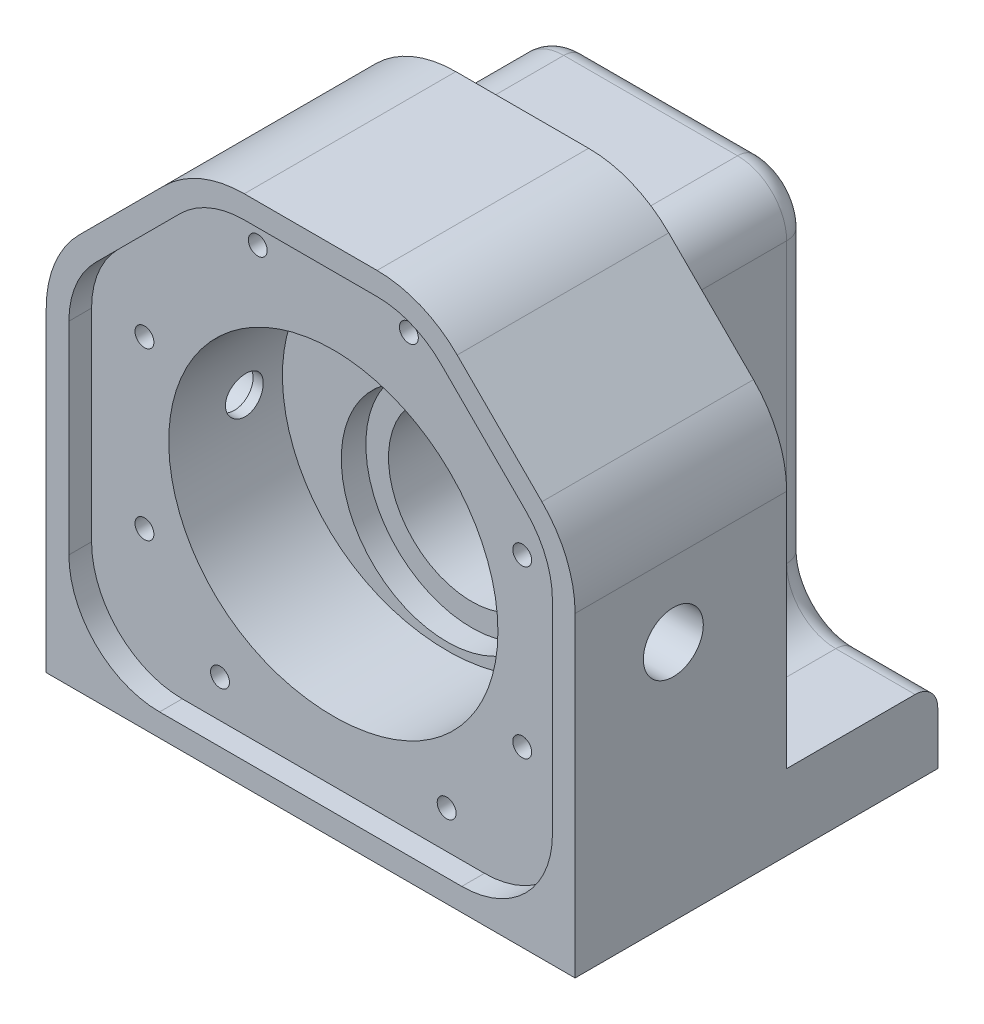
ISO-10303-21;
HEADER;
FILE_DESCRIPTION(('STEP AP214'),'2;1');
FILE_NAME('part.step','',(''),(''),'','','');
FILE_SCHEMA(('AUTOMOTIVE_DESIGN { 1 0 10303 214 1 1 1 1 }'));
ENDSEC;
DATA;
#1=APPLICATION_CONTEXT('core data for automotive mechanical design processes');
#2=APPLICATION_PROTOCOL_DEFINITION('international standard','automotive_design',2000,#1);
#3=PRODUCT_CONTEXT('',#1,'mechanical');
#4=PRODUCT('Part','Part','',(#3));
#5=PRODUCT_RELATED_PRODUCT_CATEGORY('part','',(#4));
#6=PRODUCT_DEFINITION_FORMATION('','',#4);
#7=PRODUCT_DEFINITION_CONTEXT('part definition',#1,'design');
#8=PRODUCT_DEFINITION('design','',#6,#7);
#9=PRODUCT_DEFINITION_SHAPE('','',#8);
#10=(LENGTH_UNIT() NAMED_UNIT(*) SI_UNIT(.MILLI.,.METRE.));
#11=(NAMED_UNIT(*) PLANE_ANGLE_UNIT() SI_UNIT($,.RADIAN.));
#12=(NAMED_UNIT(*) SI_UNIT($,.STERADIAN.) SOLID_ANGLE_UNIT());
#13=UNCERTAINTY_MEASURE_WITH_UNIT(LENGTH_MEASURE(1.E-05),#10,'distance_accuracy_value','');
#14=(GEOMETRIC_REPRESENTATION_CONTEXT(3) GLOBAL_UNCERTAINTY_ASSIGNED_CONTEXT((#13)) GLOBAL_UNIT_ASSIGNED_CONTEXT((#10,
#11,#12)) REPRESENTATION_CONTEXT('',''));
#15=CARTESIAN_POINT('',(0.,0.,0.));
#16=DIRECTION('',(0.,0.,1.));
#17=DIRECTION('',(1.,0.,0.));
#18=AXIS2_PLACEMENT_3D('',#15,#16,#17);
#19=CARTESIAN_POINT('',(0.,-6.,1.));
#20=DIRECTION('',(0.,0.,1.));
#21=DIRECTION('',(1.,0.,0.));
#22=AXIS2_PLACEMENT_3D('',#19,#20,#21);
#23=CYLINDRICAL_SURFACE('',#22,8.25);
#24=CARTESIAN_POINT('',(0.,-6.,1.));
#25=DIRECTION('',(0.,0.,1.));
#26=DIRECTION('',(1.,0.,0.));
#27=AXIS2_PLACEMENT_3D('',#24,#25,#26);
#28=CIRCLE('',#27,8.25);
#29=CARTESIAN_POINT('',(8.25,-6.,1.));
#30=VERTEX_POINT('',#29);
#31=EDGE_CURVE('E887',#30,#30,#28,.T.);
#32=ORIENTED_EDGE('',*,*,#31,.F.);
#33=EDGE_LOOP('',(#32));
#34=FACE_BOUND('',#33,.T.);
#35=CARTESIAN_POINT('',(0.,-6.,4.69999999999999));
#36=DIRECTION('',(0.,0.,1.));
#37=DIRECTION('',(1.,0.,0.));
#38=AXIS2_PLACEMENT_3D('',#35,#36,#37);
#39=CIRCLE('',#38,8.25);
#40=CARTESIAN_POINT('',(8.25,-6.,4.69999999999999));
#41=VERTEX_POINT('',#40);
#42=EDGE_CURVE('E369',#41,#41,#39,.F.);
#43=ORIENTED_EDGE('',*,*,#42,.F.);
#44=EDGE_LOOP('',(#43));
#45=FACE_BOUND('',#44,.T.);
#46=ADVANCED_FACE('F36',(#34,#45),#23,.F.);
#47=CARTESIAN_POINT('',(-35.,-32.,50.));
#48=DIRECTION('',(1.,0.,0.));
#49=DIRECTION('',(0.,0.,-1.));
#50=AXIS2_PLACEMENT_3D('',#47,#48,#49);
#51=PLANE('',#50);
#52=CARTESIAN_POINT('',(-35.,0.,36.));
#53=DIRECTION('',(-1.,0.,0.));
#54=DIRECTION('',(0.,0.,1.));
#55=AXIS2_PLACEMENT_3D('',#52,#53,#54);
#56=CIRCLE('',#55,3.96875);
#57=CARTESIAN_POINT('',(-35.,0.,39.96875));
#58=VERTEX_POINT('',#57);
#59=EDGE_CURVE('E319',#58,#58,#56,.T.);
#60=ORIENTED_EDGE('',*,*,#59,.F.);
#61=EDGE_LOOP('',(#60));
#62=FACE_BOUND('',#61,.T.);
#63=DIRECTION('',(0.,0.,-1.));
#64=VECTOR('',#63,1.);
#65=CARTESIAN_POINT('',(-35.,-22.,21.));
#66=LINE('',#65,#64);
#67=CARTESIAN_POINT('',(-35.,-22.,21.));
#68=VERTEX_POINT('',#67);
#69=CARTESIAN_POINT('',(-35.,-22.,4.));
#70=VERTEX_POINT('',#69);
#71=EDGE_CURVE('E705',#68,#70,#66,.T.);
#72=ORIENTED_EDGE('',*,*,#71,.T.);
#73=CARTESIAN_POINT('',(-35.,-25.,4.));
#74=DIRECTION('',(1.,0.,0.));
#75=DIRECTION('',(0.,0.,-1.));
#76=AXIS2_PLACEMENT_3D('',#73,#74,#75);
#77=CIRCLE('',#76,3.);
#78=CARTESIAN_POINT('',(-35.,-25.,1.));
#79=VERTEX_POINT('',#78);
#80=EDGE_CURVE('E13',#70,#79,#77,.F.);
#81=ORIENTED_EDGE('',*,*,#80,.T.);
#82=DIRECTION('',(0.,1.,0.));
#83=VECTOR('',#82,1.);
#84=CARTESIAN_POINT('',(-35.,-32.,1.));
#85=LINE('',#84,#83);
#86=CARTESIAN_POINT('',(-35.,-32.,1.));
#87=VERTEX_POINT('',#86);
#88=EDGE_CURVE('E649',#87,#79,#85,.T.);
#89=ORIENTED_EDGE('',*,*,#88,.F.);
#90=DIRECTION('',(0.,0.,-1.));
#91=VECTOR('',#90,1.);
#92=CARTESIAN_POINT('',(-35.,-32.,50.));
#93=LINE('',#92,#91);
#94=CARTESIAN_POINT('',(-35.,-32.,49.));
#95=VERTEX_POINT('',#94);
#96=EDGE_CURVE('E635',#95,#87,#93,.T.);
#97=ORIENTED_EDGE('',*,*,#96,.F.);
#98=DIRECTION('',(0.,-1.,0.));
#99=VECTOR('',#98,1.);
#100=CARTESIAN_POINT('',(-35.,38.,49.));
#101=LINE('',#100,#99);
#102=CARTESIAN_POINT('',(-35.,9.78679656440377,49.));
#103=VERTEX_POINT('',#102);
#104=EDGE_CURVE('E765',#103,#95,#101,.T.);
#105=ORIENTED_EDGE('',*,*,#104,.F.);
#106=DIRECTION('',(0.,0.,1.));
#107=VECTOR('',#106,1.);
#108=CARTESIAN_POINT('',(-35.,9.78679656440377,19.));
#109=LINE('',#108,#107);
#110=CARTESIAN_POINT('',(-35.,9.78679656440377,21.));
#111=VERTEX_POINT('',#110);
#112=EDGE_CURVE('E832',#111,#103,#109,.T.);
#113=ORIENTED_EDGE('',*,*,#112,.F.);
#114=DIRECTION('',(0.,1.,0.));
#115=VECTOR('',#114,1.);
#116=CARTESIAN_POINT('',(-35.,-32.,21.));
#117=LINE('',#116,#115);
#118=EDGE_CURVE('E654',#68,#111,#117,.T.);
#119=ORIENTED_EDGE('',*,*,#118,.F.);
#120=EDGE_LOOP('',(#72,#81,#89,#97,#105,#113,#119));
#121=FACE_BOUND('',#120,.T.);
#122=ADVANCED_FACE('F38',(#62,#121),#51,.F.);
#123=CARTESIAN_POINT('',(0.,3.,21.));
#124=DIRECTION('',(0.,0.,-1.));
#125=DIRECTION('',(-1.,0.,0.));
#126=AXIS2_PLACEMENT_3D('',#123,#124,#125);
#127=PLANE('',#126);
#128=DIRECTION('',(0.707106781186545,-0.70710678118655,0.));
#129=VECTOR('',#128,1.);
#130=CARTESIAN_POINT('',(24.,26.9999999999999,21.));
#131=LINE('',#130,#129);
#132=CARTESIAN_POINT('',(19.3933982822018,31.6066017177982,21.));
#133=VERTEX_POINT('',#132);
#134=CARTESIAN_POINT('',(30.6066017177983,20.3933982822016,21.));
#135=VERTEX_POINT('',#134);
#136=EDGE_CURVE('E862',#133,#135,#131,.T.);
#137=ORIENTED_EDGE('',*,*,#136,.T.);
#138=CARTESIAN_POINT('',(20.,9.78679656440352,21.));
#139=DIRECTION('',(0.,0.,-1.));
#140=DIRECTION('',(-1.,0.,0.));
#141=AXIS2_PLACEMENT_3D('',#138,#139,#140);
#142=CIRCLE('',#141,15.);
#143=CARTESIAN_POINT('',(35.,9.78679656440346,21.));
#144=VERTEX_POINT('',#143);
#145=EDGE_CURVE('E859',#135,#144,#142,.T.);
#146=ORIENTED_EDGE('',*,*,#145,.T.);
#147=DIRECTION('',(0.,-1.,0.));
#148=VECTOR('',#147,1.);
#149=CARTESIAN_POINT('',(35.,-32.,21.));
#150=LINE('',#149,#148);
#151=CARTESIAN_POINT('',(35.,-22.,21.));
#152=VERTEX_POINT('',#151);
#153=EDGE_CURVE('E800',#144,#152,#150,.T.);
#154=ORIENTED_EDGE('',*,*,#153,.T.);
#155=DIRECTION('',(1.,0.,0.));
#156=VECTOR('',#155,1.);
#157=CARTESIAN_POINT('',(35.,-22.,21.));
#158=LINE('',#157,#156);
#159=CARTESIAN_POINT('',(24.5,-22.,21.));
#160=VERTEX_POINT('',#159);
#161=EDGE_CURVE('E796',#160,#152,#158,.T.);
#162=ORIENTED_EDGE('',*,*,#161,.F.);
#163=CARTESIAN_POINT('',(24.5,-15.5,21.));
#164=DIRECTION('',(0.,0.,1.));
#165=DIRECTION('',(-1.,0.,0.));
#166=AXIS2_PLACEMENT_3D('',#163,#164,#165);
#167=CIRCLE('',#166,6.5);
#168=CARTESIAN_POINT('',(18.,-15.5,21.));
#169=VERTEX_POINT('',#168);
#170=EDGE_CURVE('E793',#169,#160,#167,.T.);
#171=ORIENTED_EDGE('',*,*,#170,.F.);
#172=DIRECTION('',(0.,-1.,0.));
#173=VECTOR('',#172,1.);
#174=CARTESIAN_POINT('',(18.,-15.5,21.));
#175=LINE('',#174,#173);
#176=CARTESIAN_POINT('',(18.,21.5,21.));
#177=VERTEX_POINT('',#176);
#178=EDGE_CURVE('E790',#177,#169,#175,.T.);
#179=ORIENTED_EDGE('',*,*,#178,.F.);
#180=CARTESIAN_POINT('',(11.5,21.5,21.));
#181=DIRECTION('',(0.,0.,-1.));
#182=DIRECTION('',(1.,0.,0.));
#183=AXIS2_PLACEMENT_3D('',#180,#181,#182);
#184=CIRCLE('',#183,6.5);
#185=CARTESIAN_POINT('',(11.5,28.,21.));
#186=VERTEX_POINT('',#185);
#187=EDGE_CURVE('E787',#186,#177,#184,.T.);
#188=ORIENTED_EDGE('',*,*,#187,.F.);
#189=DIRECTION('',(1.,0.,0.));
#190=VECTOR('',#189,1.);
#191=CARTESIAN_POINT('',(11.5,28.,21.));
#192=LINE('',#191,#190);
#193=CARTESIAN_POINT('',(-11.5,28.,21.));
#194=VERTEX_POINT('',#193);
#195=EDGE_CURVE('E784',#194,#186,#192,.T.);
#196=ORIENTED_EDGE('',*,*,#195,.F.);
#197=CARTESIAN_POINT('',(-11.5,21.5,21.));
#198=DIRECTION('',(0.,0.,-1.));
#199=DIRECTION('',(-1.,0.,0.));
#200=AXIS2_PLACEMENT_3D('',#197,#198,#199);
#201=CIRCLE('',#200,6.5);
#202=CARTESIAN_POINT('',(-18.,21.5,21.));
#203=VERTEX_POINT('',#202);
#204=EDGE_CURVE('E781',#203,#194,#201,.T.);
#205=ORIENTED_EDGE('',*,*,#204,.F.);
#206=DIRECTION('',(0.,1.,0.));
#207=VECTOR('',#206,1.);
#208=CARTESIAN_POINT('',(-18.,21.5,21.));
#209=LINE('',#208,#207);
#210=CARTESIAN_POINT('',(-18.,-15.5,21.));
#211=VERTEX_POINT('',#210);
#212=EDGE_CURVE('E778',#211,#203,#209,.T.);
#213=ORIENTED_EDGE('',*,*,#212,.F.);
#214=CARTESIAN_POINT('',(-24.5,-15.5,21.));
#215=DIRECTION('',(0.,0.,1.));
#216=DIRECTION('',(-1.,0.,0.));
#217=AXIS2_PLACEMENT_3D('',#214,#215,#216);
#218=CIRCLE('',#217,6.5);
#219=CARTESIAN_POINT('',(-24.5,-22.,21.));
#220=VERTEX_POINT('',#219);
#221=EDGE_CURVE('E775',#220,#211,#218,.T.);
#222=ORIENTED_EDGE('',*,*,#221,.F.);
#223=DIRECTION('',(1.,0.,0.));
#224=VECTOR('',#223,1.);
#225=CARTESIAN_POINT('',(-24.5,-22.,21.));
#226=LINE('',#225,#224);
#227=EDGE_CURVE('E773',#68,#220,#226,.T.);
#228=ORIENTED_EDGE('',*,*,#227,.F.);
#229=ORIENTED_EDGE('',*,*,#118,.T.);
#230=CARTESIAN_POINT('',(-20.,9.78679656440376,21.));
#231=DIRECTION('',(0.,0.,-1.));
#232=DIRECTION('',(-1.,0.,0.));
#233=AXIS2_PLACEMENT_3D('',#230,#231,#232);
#234=CIRCLE('',#233,15.);
#235=CARTESIAN_POINT('',(-30.6066017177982,20.393398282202,21.));
#236=VERTEX_POINT('',#235);
#237=EDGE_CURVE('E829',#111,#236,#234,.T.);
#238=ORIENTED_EDGE('',*,*,#237,.T.);
#239=DIRECTION('',(0.707106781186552,0.707106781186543,0.));
#240=VECTOR('',#239,1.);
#241=CARTESIAN_POINT('',(-23.9999999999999,27.0000000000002,21.));
#242=LINE('',#241,#240);
#243=CARTESIAN_POINT('',(-19.3933982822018,31.6066017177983,21.));
#244=VERTEX_POINT('',#243);
#245=EDGE_CURVE('E856',#236,#244,#242,.T.);
#246=ORIENTED_EDGE('',*,*,#245,.T.);
#247=CARTESIAN_POINT('',(-8.78679656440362,21.,21.));
#248=DIRECTION('',(0.,0.,-1.));
#249=DIRECTION('',(-1.,0.,0.));
#250=AXIS2_PLACEMENT_3D('',#247,#248,#249);
#251=CIRCLE('',#250,15.);
#252=CARTESIAN_POINT('',(-8.78679656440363,36.,21.));
#253=VERTEX_POINT('',#252);
#254=EDGE_CURVE('E852',#244,#253,#251,.T.);
#255=ORIENTED_EDGE('',*,*,#254,.T.);
#256=DIRECTION('',(1.,0.,0.));
#257=VECTOR('',#256,1.);
#258=CARTESIAN_POINT('',(0.,36.,21.));
#259=LINE('',#258,#257);
#260=CARTESIAN_POINT('',(8.78679656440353,36.,21.));
#261=VERTEX_POINT('',#260);
#262=EDGE_CURVE('E849',#253,#261,#259,.T.);
#263=ORIENTED_EDGE('',*,*,#262,.T.);
#264=CARTESIAN_POINT('',(8.78679656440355,21.,21.));
#265=DIRECTION('',(0.,0.,-1.));
#266=DIRECTION('',(-1.,0.,0.));
#267=AXIS2_PLACEMENT_3D('',#264,#265,#266);
#268=CIRCLE('',#267,15.);
#269=EDGE_CURVE('E863',#261,#133,#268,.T.);
#270=ORIENTED_EDGE('',*,*,#269,.T.);
#271=EDGE_LOOP('',(#137,#146,#154,#162,#171,#179,#188,#196,#205,#213,#222,#228,#229,#238,#246,
#255,#263,#270));
#272=FACE_BOUND('',#271,.T.);
#273=ADVANCED_FACE('F506',(#272),#127,.T.);
#274=CARTESIAN_POINT('',(-35.,-32.,49.));
#275=DIRECTION('',(0.,0.,-1.));
#276=DIRECTION('',(-1.,0.,0.));
#277=AXIS2_PLACEMENT_3D('',#274,#275,#276);
#278=PLANE('',#277);
#279=DIRECTION('',(1.,0.,0.));
#280=VECTOR('',#279,1.);
#281=CARTESIAN_POINT('',(-19.9999999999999,-29.,49.));
#282=LINE('',#281,#280);
#283=CARTESIAN_POINT('',(-19.9999999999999,-29.,49.));
#284=VERTEX_POINT('',#283);
#285=CARTESIAN_POINT('',(19.9999999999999,-29.,49.));
#286=VERTEX_POINT('',#285);
#287=EDGE_CURVE('E982',#284,#286,#282,.T.);
#288=ORIENTED_EDGE('',*,*,#287,.F.);
#289=CARTESIAN_POINT('',(-20.,-17.,49.));
#290=DIRECTION('',(0.,0.,1.));
#291=DIRECTION('',(-1.,0.,0.));
#292=AXIS2_PLACEMENT_3D('',#289,#290,#291);
#293=CIRCLE('',#292,12.);
#294=CARTESIAN_POINT('',(-32.,-16.9999999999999,49.));
#295=VERTEX_POINT('',#294);
#296=EDGE_CURVE('E53',#295,#284,#293,.T.);
#297=ORIENTED_EDGE('',*,*,#296,.F.);
#298=DIRECTION('',(0.,-1.,0.));
#299=VECTOR('',#298,1.);
#300=CARTESIAN_POINT('',(-32.,9.78679656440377,49.));
#301=LINE('',#300,#299);
#302=CARTESIAN_POINT('',(-32.,9.78679656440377,49.));
#303=VERTEX_POINT('',#302);
#304=EDGE_CURVE('E953',#303,#295,#301,.T.);
#305=ORIENTED_EDGE('',*,*,#304,.F.);
#306=CARTESIAN_POINT('',(-20.,9.78679656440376,49.));
#307=DIRECTION('',(0.,0.,1.));
#308=DIRECTION('',(1.,0.,0.));
#309=AXIS2_PLACEMENT_3D('',#306,#307,#308);
#310=CIRCLE('',#309,12.);
#311=CARTESIAN_POINT('',(-28.4852813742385,18.2720779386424,49.));
#312=VERTEX_POINT('',#311);
#313=EDGE_CURVE('E956',#312,#303,#310,.T.);
#314=ORIENTED_EDGE('',*,*,#313,.F.);
#315=DIRECTION('',(-0.707106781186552,-0.707106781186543,0.));
#316=VECTOR('',#315,1.);
#317=CARTESIAN_POINT('',(-17.2720779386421,29.4852813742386,49.));
#318=LINE('',#317,#316);
#319=CARTESIAN_POINT('',(-17.2720779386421,29.4852813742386,49.));
#320=VERTEX_POINT('',#319);
#321=EDGE_CURVE('E959',#320,#312,#318,.T.);
#322=ORIENTED_EDGE('',*,*,#321,.F.);
#323=CARTESIAN_POINT('',(-8.78679656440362,21.,49.));
#324=DIRECTION('',(0.,0.,1.));
#325=DIRECTION('',(1.,0.,0.));
#326=AXIS2_PLACEMENT_3D('',#323,#324,#325);
#327=CIRCLE('',#326,12.);
#328=CARTESIAN_POINT('',(-8.78679656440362,33.,49.));
#329=VERTEX_POINT('',#328);
#330=EDGE_CURVE('E962',#329,#320,#327,.T.);
#331=ORIENTED_EDGE('',*,*,#330,.F.);
#332=DIRECTION('',(-1.,0.,0.));
#333=VECTOR('',#332,1.);
#334=CARTESIAN_POINT('',(8.78679656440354,33.,49.));
#335=LINE('',#334,#333);
#336=CARTESIAN_POINT('',(8.78679656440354,33.,49.));
#337=VERTEX_POINT('',#336);
#338=EDGE_CURVE('E965',#337,#329,#335,.T.);
#339=ORIENTED_EDGE('',*,*,#338,.F.);
#340=CARTESIAN_POINT('',(8.78679656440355,21.,49.));
#341=DIRECTION('',(0.,0.,1.));
#342=DIRECTION('',(1.,0.,0.));
#343=AXIS2_PLACEMENT_3D('',#340,#341,#342);
#344=CIRCLE('',#343,12.);
#345=CARTESIAN_POINT('',(17.2720779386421,29.4852813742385,49.));
#346=VERTEX_POINT('',#345);
#347=EDGE_CURVE('E968',#346,#337,#344,.T.);
#348=ORIENTED_EDGE('',*,*,#347,.F.);
#349=DIRECTION('',(-0.707106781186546,0.707106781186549,0.));
#350=VECTOR('',#349,1.);
#351=CARTESIAN_POINT('',(28.4852813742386,18.272077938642,49.));
#352=LINE('',#351,#350);
#353=CARTESIAN_POINT('',(28.4852813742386,18.272077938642,49.));
#354=VERTEX_POINT('',#353);
#355=EDGE_CURVE('E971',#354,#346,#352,.T.);
#356=ORIENTED_EDGE('',*,*,#355,.F.);
#357=CARTESIAN_POINT('',(20.,9.78679656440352,49.));
#358=DIRECTION('',(0.,0.,1.));
#359=DIRECTION('',(1.,0.,0.));
#360=AXIS2_PLACEMENT_3D('',#357,#358,#359);
#361=CIRCLE('',#360,12.);
#362=CARTESIAN_POINT('',(32.,9.78679656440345,49.));
#363=VERTEX_POINT('',#362);
#364=EDGE_CURVE('E974',#363,#354,#361,.T.);
#365=ORIENTED_EDGE('',*,*,#364,.F.);
#366=DIRECTION('',(0.,1.,0.));
#367=VECTOR('',#366,1.);
#368=CARTESIAN_POINT('',(32.,-16.9999999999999,49.));
#369=LINE('',#368,#367);
#370=CARTESIAN_POINT('',(32.,-16.9999999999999,49.));
#371=VERTEX_POINT('',#370);
#372=EDGE_CURVE('E977',#371,#363,#369,.T.);
#373=ORIENTED_EDGE('',*,*,#372,.F.);
#374=CARTESIAN_POINT('',(20.,-17.,49.));
#375=DIRECTION('',(0.,0.,1.));
#376=DIRECTION('',(-1.,0.,0.));
#377=AXIS2_PLACEMENT_3D('',#374,#375,#376);
#378=CIRCLE('',#377,12.);
#379=EDGE_CURVE('E980',#286,#371,#378,.T.);
#380=ORIENTED_EDGE('',*,*,#379,.F.);
#381=EDGE_LOOP('',(#288,#297,#305,#314,#322,#331,#339,#348,#356,#365,#373,#380));
#382=FACE_BOUND('',#381,.T.);
#383=CARTESIAN_POINT('',(20.,9.78679656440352,49.));
#384=DIRECTION('',(0.,0.,1.));
#385=DIRECTION('',(-1.,0.,0.));
#386=AXIS2_PLACEMENT_3D('',#383,#384,#385);
#387=CIRCLE('',#386,15.);
#388=CARTESIAN_POINT('',(35.,9.78679656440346,49.));
#389=VERTEX_POINT('',#388);
#390=CARTESIAN_POINT('',(30.6066017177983,20.3933982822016,49.));
#391=VERTEX_POINT('',#390);
#392=EDGE_CURVE('E870',#389,#391,#387,.T.);
#393=ORIENTED_EDGE('',*,*,#392,.T.);
#394=DIRECTION('',(-0.707106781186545,0.70710678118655,0.));
#395=VECTOR('',#394,1.);
#396=CARTESIAN_POINT('',(19.3933982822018,31.6066017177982,49.));
#397=LINE('',#396,#395);
#398=CARTESIAN_POINT('',(19.3933982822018,31.6066017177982,49.));
#399=VERTEX_POINT('',#398);
#400=EDGE_CURVE('E848',#391,#399,#397,.T.);
#401=ORIENTED_EDGE('',*,*,#400,.T.);
#402=CARTESIAN_POINT('',(8.78679656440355,21.,49.));
#403=DIRECTION('',(0.,0.,1.));
#404=DIRECTION('',(1.,0.,0.));
#405=AXIS2_PLACEMENT_3D('',#402,#403,#404);
#406=CIRCLE('',#405,15.);
#407=CARTESIAN_POINT('',(8.78679656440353,36.,49.));
#408=VERTEX_POINT('',#407);
#409=EDGE_CURVE('E884',#399,#408,#406,.T.);
#410=ORIENTED_EDGE('',*,*,#409,.T.);
#411=DIRECTION('',(-1.,0.,0.));
#412=VECTOR('',#411,1.);
#413=CARTESIAN_POINT('',(-8.78679656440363,36.,49.));
#414=LINE('',#413,#412);
#415=CARTESIAN_POINT('',(-8.78679656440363,36.,49.));
#416=VERTEX_POINT('',#415);
#417=EDGE_CURVE('E886',#408,#416,#414,.T.);
#418=ORIENTED_EDGE('',*,*,#417,.T.);
#419=CARTESIAN_POINT('',(-8.78679656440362,21.,49.));
#420=DIRECTION('',(0.,0.,1.));
#421=DIRECTION('',(-1.,0.,0.));
#422=AXIS2_PLACEMENT_3D('',#419,#420,#421);
#423=CIRCLE('',#422,15.);
#424=CARTESIAN_POINT('',(-19.3933982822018,31.6066017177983,49.));
#425=VERTEX_POINT('',#424);
#426=EDGE_CURVE('E61',#416,#425,#423,.T.);
#427=ORIENTED_EDGE('',*,*,#426,.T.);
#428=DIRECTION('',(-0.707106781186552,-0.707106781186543,0.));
#429=VECTOR('',#428,1.);
#430=CARTESIAN_POINT('',(-19.3933982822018,31.6066017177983,49.));
#431=LINE('',#430,#429);
#432=CARTESIAN_POINT('',(-30.6066017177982,20.393398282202,49.));
#433=VERTEX_POINT('',#432);
#434=EDGE_CURVE('E868',#425,#433,#431,.T.);
#435=ORIENTED_EDGE('',*,*,#434,.T.);
#436=CARTESIAN_POINT('',(-20.,9.78679656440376,49.));
#437=DIRECTION('',(0.,0.,1.));
#438=DIRECTION('',(1.,0.,0.));
#439=AXIS2_PLACEMENT_3D('',#436,#437,#438);
#440=CIRCLE('',#439,15.);
#441=EDGE_CURVE('E866',#433,#103,#440,.T.);
#442=ORIENTED_EDGE('',*,*,#441,.T.);
#443=ORIENTED_EDGE('',*,*,#104,.T.);
#444=DIRECTION('',(1.,0.,0.));
#445=VECTOR('',#444,1.);
#446=CARTESIAN_POINT('',(-35.,-32.,49.));
#447=LINE('',#446,#445);
#448=CARTESIAN_POINT('',(35.,-32.,49.));
#449=VERTEX_POINT('',#448);
#450=EDGE_CURVE('E639',#95,#449,#447,.T.);
#451=ORIENTED_EDGE('',*,*,#450,.T.);
#452=DIRECTION('',(0.,1.,0.));
#453=VECTOR('',#452,1.);
#454=CARTESIAN_POINT('',(35.,-32.,49.));
#455=LINE('',#454,#453);
#456=EDGE_CURVE('E752',#449,#389,#455,.T.);
#457=ORIENTED_EDGE('',*,*,#456,.T.);
#458=EDGE_LOOP('',(#393,#401,#410,#418,#427,#435,#442,#443,#451,#457));
#459=FACE_BOUND('',#458,.T.);
#460=ADVANCED_FACE('F542',(#382,#459),#278,.F.);
#461=CARTESIAN_POINT('',(-35.,-32.,1.));
#462=DIRECTION('',(0.,0.,-1.));
#463=DIRECTION('',(-1.,0.,0.));
#464=AXIS2_PLACEMENT_3D('',#461,#462,#463);
#465=PLANE('',#464);
#466=ORIENTED_EDGE('',*,*,#31,.T.);
#467=EDGE_LOOP('',(#466));
#468=FACE_BOUND('',#467,.T.);
#469=CARTESIAN_POINT('',(24.5,-15.5,1.));
#470=DIRECTION('',(0.,0.,-1.));
#471=DIRECTION('',(-1.,0.,0.));
#472=AXIS2_PLACEMENT_3D('',#469,#470,#471);
#473=CIRCLE('',#472,9.5);
#474=CARTESIAN_POINT('',(15.,-15.4999999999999,1.));
#475=VERTEX_POINT('',#474);
#476=CARTESIAN_POINT('',(24.5,-25.,1.));
#477=VERTEX_POINT('',#476);
#478=EDGE_CURVE('E675',#475,#477,#473,.F.);
#479=ORIENTED_EDGE('',*,*,#478,.T.);
#480=DIRECTION('',(1.,0.,0.));
#481=VECTOR('',#480,1.);
#482=CARTESIAN_POINT('',(-35.,-25.,1.));
#483=LINE('',#482,#481);
#484=CARTESIAN_POINT('',(35.,-25.,1.));
#485=VERTEX_POINT('',#484);
#486=EDGE_CURVE('E677',#477,#485,#483,.T.);
#487=ORIENTED_EDGE('',*,*,#486,.T.);
#488=DIRECTION('',(0.,-1.,0.));
#489=VECTOR('',#488,1.);
#490=CARTESIAN_POINT('',(35.,38.,1.));
#491=LINE('',#490,#489);
#492=CARTESIAN_POINT('',(35.,-32.,1.));
#493=VERTEX_POINT('',#492);
#494=EDGE_CURVE('E653',#485,#493,#491,.T.);
#495=ORIENTED_EDGE('',*,*,#494,.T.);
#496=DIRECTION('',(-1.,0.,0.));
#497=VECTOR('',#496,1.);
#498=CARTESIAN_POINT('',(35.,-32.,1.));
#499=LINE('',#498,#497);
#500=EDGE_CURVE('E638',#493,#87,#499,.T.);
#501=ORIENTED_EDGE('',*,*,#500,.T.);
#502=ORIENTED_EDGE('',*,*,#88,.T.);
#503=DIRECTION('',(1.,0.,0.));
#504=VECTOR('',#503,1.);
#505=CARTESIAN_POINT('',(-35.,-25.,1.));
#506=LINE('',#505,#504);
#507=CARTESIAN_POINT('',(-24.5000000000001,-25.,1.));
#508=VERTEX_POINT('',#507);
#509=EDGE_CURVE('E643',#79,#508,#506,.T.);
#510=ORIENTED_EDGE('',*,*,#509,.T.);
#511=CARTESIAN_POINT('',(-24.5,-15.5,1.));
#512=DIRECTION('',(0.,0.,-1.));
#513=DIRECTION('',(-1.,0.,0.));
#514=AXIS2_PLACEMENT_3D('',#511,#512,#513);
#515=CIRCLE('',#514,9.5);
#516=CARTESIAN_POINT('',(-15.,-15.5,1.));
#517=VERTEX_POINT('',#516);
#518=EDGE_CURVE('E663',#508,#517,#515,.F.);
#519=ORIENTED_EDGE('',*,*,#518,.T.);
#520=DIRECTION('',(0.,1.,0.));
#521=VECTOR('',#520,1.);
#522=CARTESIAN_POINT('',(-15.,-32.,1.));
#523=LINE('',#522,#521);
#524=CARTESIAN_POINT('',(-15.,21.5,1.));
#525=VERTEX_POINT('',#524);
#526=EDGE_CURVE('E665',#517,#525,#523,.T.);
#527=ORIENTED_EDGE('',*,*,#526,.T.);
#528=CARTESIAN_POINT('',(-11.5,21.5,1.));
#529=DIRECTION('',(0.,0.,-1.));
#530=DIRECTION('',(-1.,0.,0.));
#531=AXIS2_PLACEMENT_3D('',#528,#529,#530);
#532=CIRCLE('',#531,3.5);
#533=CARTESIAN_POINT('',(-11.5,25.,1.));
#534=VERTEX_POINT('',#533);
#535=EDGE_CURVE('E667',#525,#534,#532,.T.);
#536=ORIENTED_EDGE('',*,*,#535,.T.);
#537=DIRECTION('',(1.,0.,0.));
#538=VECTOR('',#537,1.);
#539=CARTESIAN_POINT('',(-35.,25.,1.));
#540=LINE('',#539,#538);
#541=CARTESIAN_POINT('',(11.5,25.,1.));
#542=VERTEX_POINT('',#541);
#543=EDGE_CURVE('E669',#534,#542,#540,.T.);
#544=ORIENTED_EDGE('',*,*,#543,.T.);
#545=CARTESIAN_POINT('',(11.5,21.5,1.));
#546=DIRECTION('',(0.,0.,-1.));
#547=DIRECTION('',(-1.,0.,0.));
#548=AXIS2_PLACEMENT_3D('',#545,#546,#547);
#549=CIRCLE('',#548,3.5);
#550=CARTESIAN_POINT('',(15.,21.5,1.));
#551=VERTEX_POINT('',#550);
#552=EDGE_CURVE('E671',#542,#551,#549,.T.);
#553=ORIENTED_EDGE('',*,*,#552,.T.);
#554=DIRECTION('',(0.,-1.,0.));
#555=VECTOR('',#554,1.);
#556=CARTESIAN_POINT('',(15.,-32.,1.));
#557=LINE('',#556,#555);
#558=EDGE_CURVE('E673',#551,#475,#557,.T.);
#559=ORIENTED_EDGE('',*,*,#558,.T.);
#560=EDGE_LOOP('',(#479,#487,#495,#501,#502,#510,#519,#527,#536,#544,#553,#559));
#561=FACE_BOUND('',#560,.T.);
#562=ADVANCED_FACE('F545',(#468,#561),#465,.T.);
#563=CARTESIAN_POINT('',(-35.,-32.,50.));
#564=DIRECTION('',(0.,1.,0.));
#565=DIRECTION('',(0.,0.,1.));
#566=AXIS2_PLACEMENT_3D('',#563,#564,#565);
#567=PLANE('',#566);
#568=ORIENTED_EDGE('',*,*,#96,.T.);
#569=ORIENTED_EDGE('',*,*,#500,.F.);
#570=DIRECTION('',(0.,0.,-1.));
#571=VECTOR('',#570,1.);
#572=CARTESIAN_POINT('',(35.,-32.,50.));
#573=LINE('',#572,#571);
#574=EDGE_CURVE('E644',#449,#493,#573,.T.);
#575=ORIENTED_EDGE('',*,*,#574,.F.);
#576=ORIENTED_EDGE('',*,*,#450,.F.);
#577=EDGE_LOOP('',(#568,#569,#575,#576));
#578=FACE_BOUND('',#577,.T.);
#579=ADVANCED_FACE('F624',(#578),#567,.F.);
#580=CARTESIAN_POINT('',(35.,-32.,50.));
#581=DIRECTION('',(-1.,0.,0.));
#582=DIRECTION('',(0.,0.,1.));
#583=AXIS2_PLACEMENT_3D('',#580,#581,#582);
#584=PLANE('',#583);
#585=CARTESIAN_POINT('',(35.,0.,36.));
#586=DIRECTION('',(1.,0.,0.));
#587=DIRECTION('',(0.,0.,-1.));
#588=AXIS2_PLACEMENT_3D('',#585,#586,#587);
#589=CIRCLE('',#588,3.96875);
#590=CARTESIAN_POINT('',(35.,0.,32.03125));
#591=VERTEX_POINT('',#590);
#592=EDGE_CURVE('E1343',#591,#591,#589,.T.);
#593=ORIENTED_EDGE('',*,*,#592,.F.);
#594=EDGE_LOOP('',(#593));
#595=FACE_BOUND('',#594,.T.);
#596=ORIENTED_EDGE('',*,*,#574,.T.);
#597=ORIENTED_EDGE('',*,*,#494,.F.);
#598=CARTESIAN_POINT('',(35.,-25.,4.));
#599=DIRECTION('',(-1.,0.,0.));
#600=DIRECTION('',(0.,0.,1.));
#601=AXIS2_PLACEMENT_3D('',#598,#599,#600);
#602=CIRCLE('',#601,3.);
#603=CARTESIAN_POINT('',(35.,-22.,4.));
#604=VERTEX_POINT('',#603);
#605=EDGE_CURVE('E679',#485,#604,#602,.F.);
#606=ORIENTED_EDGE('',*,*,#605,.T.);
#607=DIRECTION('',(0.,0.,-1.));
#608=VECTOR('',#607,1.);
#609=CARTESIAN_POINT('',(35.,-22.,21.));
#610=LINE('',#609,#608);
#611=EDGE_CURVE('E757',#152,#604,#610,.T.);
#612=ORIENTED_EDGE('',*,*,#611,.F.);
#613=ORIENTED_EDGE('',*,*,#153,.F.);
#614=DIRECTION('',(0.,0.,1.));
#615=VECTOR('',#614,1.);
#616=CARTESIAN_POINT('',(35.,9.78679656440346,19.));
#617=LINE('',#616,#615);
#618=EDGE_CURVE('E761',#144,#389,#617,.T.);
#619=ORIENTED_EDGE('',*,*,#618,.T.);
#620=ORIENTED_EDGE('',*,*,#456,.F.);
#621=EDGE_LOOP('',(#596,#597,#606,#612,#613,#619,#620));
#622=FACE_BOUND('',#621,.T.);
#623=ADVANCED_FACE('F587',(#595,#622),#584,.F.);
#624=CARTESIAN_POINT('',(35.,-22.,21.));
#625=DIRECTION('',(0.,1.,0.));
#626=DIRECTION('',(0.,0.,1.));
#627=AXIS2_PLACEMENT_3D('',#624,#625,#626);
#628=PLANE('',#627);
#629=ORIENTED_EDGE('',*,*,#611,.T.);
#630=DIRECTION('',(1.,0.,0.));
#631=VECTOR('',#630,1.);
#632=CARTESIAN_POINT('',(35.,-22.,4.));
#633=LINE('',#632,#631);
#634=CARTESIAN_POINT('',(24.5,-22.,4.));
#635=VERTEX_POINT('',#634);
#636=EDGE_CURVE('E682',#604,#635,#633,.F.);
#637=ORIENTED_EDGE('',*,*,#636,.T.);
#638=DIRECTION('',(0.,0.,-1.));
#639=VECTOR('',#638,1.);
#640=CARTESIAN_POINT('',(24.5,-22.,21.));
#641=LINE('',#640,#639);
#642=EDGE_CURVE('E801',#160,#635,#641,.T.);
#643=ORIENTED_EDGE('',*,*,#642,.F.);
#644=ORIENTED_EDGE('',*,*,#161,.T.);
#645=EDGE_LOOP('',(#629,#637,#643,#644));
#646=FACE_BOUND('',#645,.T.);
#647=ADVANCED_FACE('F583',(#646),#628,.T.);
#648=CARTESIAN_POINT('',(24.5,-15.5,21.));
#649=DIRECTION('',(0.,0.,-1.));
#650=DIRECTION('',(-1.,0.,0.));
#651=AXIS2_PLACEMENT_3D('',#648,#649,#650);
#652=CYLINDRICAL_SURFACE('',#651,6.5);
#653=ORIENTED_EDGE('',*,*,#642,.T.);
#654=CARTESIAN_POINT('',(24.5,-15.5,4.));
#655=DIRECTION('',(0.,0.,-1.));
#656=DIRECTION('',(-1.,0.,0.));
#657=AXIS2_PLACEMENT_3D('',#654,#655,#656);
#658=CIRCLE('',#657,6.5);
#659=CARTESIAN_POINT('',(18.,-15.5,4.));
#660=VERTEX_POINT('',#659);
#661=EDGE_CURVE('E684',#635,#660,#658,.T.);
#662=ORIENTED_EDGE('',*,*,#661,.T.);
#663=DIRECTION('',(0.,0.,-1.));
#664=VECTOR('',#663,1.);
#665=CARTESIAN_POINT('',(18.,-15.5,21.));
#666=LINE('',#665,#664);
#667=EDGE_CURVE('E804',#169,#660,#666,.T.);
#668=ORIENTED_EDGE('',*,*,#667,.F.);
#669=ORIENTED_EDGE('',*,*,#170,.T.);
#670=EDGE_LOOP('',(#653,#662,#668,#669));
#671=FACE_BOUND('',#670,.T.);
#672=ADVANCED_FACE('F586',(#671),#652,.F.);
#673=CARTESIAN_POINT('',(18.,-15.5,21.));
#674=DIRECTION('',(1.,0.,0.));
#675=DIRECTION('',(0.,0.,-1.));
#676=AXIS2_PLACEMENT_3D('',#673,#674,#675);
#677=PLANE('',#676);
#678=ORIENTED_EDGE('',*,*,#667,.T.);
#679=DIRECTION('',(0.,-1.,0.));
#680=VECTOR('',#679,1.);
#681=CARTESIAN_POINT('',(18.,-15.5,4.));
#682=LINE('',#681,#680);
#683=CARTESIAN_POINT('',(18.,21.5,4.));
#684=VERTEX_POINT('',#683);
#685=EDGE_CURVE('E686',#660,#684,#682,.F.);
#686=ORIENTED_EDGE('',*,*,#685,.T.);
#687=DIRECTION('',(0.,0.,-1.));
#688=VECTOR('',#687,1.);
#689=CARTESIAN_POINT('',(18.,21.5,21.));
#690=LINE('',#689,#688);
#691=EDGE_CURVE('E807',#177,#684,#690,.T.);
#692=ORIENTED_EDGE('',*,*,#691,.F.);
#693=ORIENTED_EDGE('',*,*,#178,.T.);
#694=EDGE_LOOP('',(#678,#686,#692,#693));
#695=FACE_BOUND('',#694,.T.);
#696=ADVANCED_FACE('F591',(#695),#677,.T.);
#697=CARTESIAN_POINT('',(11.5,21.5,21.));
#698=DIRECTION('',(0.,0.,-1.));
#699=DIRECTION('',(-1.,0.,0.));
#700=AXIS2_PLACEMENT_3D('',#697,#698,#699);
#701=CYLINDRICAL_SURFACE('',#700,6.5);
#702=ORIENTED_EDGE('',*,*,#691,.T.);
#703=CARTESIAN_POINT('',(11.5,21.5,4.));
#704=DIRECTION('',(0.,0.,-1.));
#705=DIRECTION('',(-1.,0.,0.));
#706=AXIS2_PLACEMENT_3D('',#703,#704,#705);
#707=CIRCLE('',#706,6.5);
#708=CARTESIAN_POINT('',(11.5,28.,4.));
#709=VERTEX_POINT('',#708);
#710=EDGE_CURVE('E688',#684,#709,#707,.F.);
#711=ORIENTED_EDGE('',*,*,#710,.T.);
#712=DIRECTION('',(0.,0.,-1.));
#713=VECTOR('',#712,1.);
#714=CARTESIAN_POINT('',(11.5,28.,21.));
#715=LINE('',#714,#713);
#716=EDGE_CURVE('E810',#186,#709,#715,.T.);
#717=ORIENTED_EDGE('',*,*,#716,.F.);
#718=ORIENTED_EDGE('',*,*,#187,.T.);
#719=EDGE_LOOP('',(#702,#711,#717,#718));
#720=FACE_BOUND('',#719,.T.);
#721=ADVANCED_FACE('F595',(#720),#701,.T.);
#722=CARTESIAN_POINT('',(11.5,28.,21.));
#723=DIRECTION('',(0.,1.,0.));
#724=DIRECTION('',(0.,0.,1.));
#725=AXIS2_PLACEMENT_3D('',#722,#723,#724);
#726=PLANE('',#725);
#727=ORIENTED_EDGE('',*,*,#716,.T.);
#728=DIRECTION('',(1.,0.,0.));
#729=VECTOR('',#728,1.);
#730=CARTESIAN_POINT('',(11.5,28.,4.));
#731=LINE('',#730,#729);
#732=CARTESIAN_POINT('',(-11.5,28.,4.));
#733=VERTEX_POINT('',#732);
#734=EDGE_CURVE('E690',#709,#733,#731,.F.);
#735=ORIENTED_EDGE('',*,*,#734,.T.);
#736=DIRECTION('',(0.,0.,-1.));
#737=VECTOR('',#736,1.);
#738=CARTESIAN_POINT('',(-11.5,28.,21.));
#739=LINE('',#738,#737);
#740=EDGE_CURVE('E813',#194,#733,#739,.T.);
#741=ORIENTED_EDGE('',*,*,#740,.F.);
#742=ORIENTED_EDGE('',*,*,#195,.T.);
#743=EDGE_LOOP('',(#727,#735,#741,#742));
#744=FACE_BOUND('',#743,.T.);
#745=ADVANCED_FACE('F599',(#744),#726,.T.);
#746=CARTESIAN_POINT('',(-11.5,21.5,21.));
#747=DIRECTION('',(0.,0.,-1.));
#748=DIRECTION('',(-1.,0.,0.));
#749=AXIS2_PLACEMENT_3D('',#746,#747,#748);
#750=CYLINDRICAL_SURFACE('',#749,6.5);
#751=ORIENTED_EDGE('',*,*,#740,.T.);
#752=CARTESIAN_POINT('',(-11.5,21.5,4.));
#753=DIRECTION('',(0.,0.,-1.));
#754=DIRECTION('',(-1.,0.,0.));
#755=AXIS2_PLACEMENT_3D('',#752,#753,#754);
#756=CIRCLE('',#755,6.5);
#757=CARTESIAN_POINT('',(-18.,21.5,4.));
#758=VERTEX_POINT('',#757);
#759=EDGE_CURVE('E692',#733,#758,#756,.F.);
#760=ORIENTED_EDGE('',*,*,#759,.T.);
#761=DIRECTION('',(0.,0.,-1.));
#762=VECTOR('',#761,1.);
#763=CARTESIAN_POINT('',(-18.,21.5,21.));
#764=LINE('',#763,#762);
#765=EDGE_CURVE('E816',#203,#758,#764,.T.);
#766=ORIENTED_EDGE('',*,*,#765,.F.);
#767=ORIENTED_EDGE('',*,*,#204,.T.);
#768=EDGE_LOOP('',(#751,#760,#766,#767));
#769=FACE_BOUND('',#768,.T.);
#770=ADVANCED_FACE('F603',(#769),#750,.T.);
#771=CARTESIAN_POINT('',(-18.,21.5,21.));
#772=DIRECTION('',(-1.,0.,0.));
#773=DIRECTION('',(0.,-1.,0.));
#774=AXIS2_PLACEMENT_3D('',#771,#772,#773);
#775=PLANE('',#774);
#776=ORIENTED_EDGE('',*,*,#765,.T.);
#777=DIRECTION('',(0.,1.,0.));
#778=VECTOR('',#777,1.);
#779=CARTESIAN_POINT('',(-18.,21.5,4.));
#780=LINE('',#779,#778);
#781=CARTESIAN_POINT('',(-18.,-15.5,4.));
#782=VERTEX_POINT('',#781);
#783=EDGE_CURVE('E694',#758,#782,#780,.F.);
#784=ORIENTED_EDGE('',*,*,#783,.T.);
#785=DIRECTION('',(0.,0.,-1.));
#786=VECTOR('',#785,1.);
#787=CARTESIAN_POINT('',(-18.,-15.5,21.));
#788=LINE('',#787,#786);
#789=EDGE_CURVE('E819',#211,#782,#788,.T.);
#790=ORIENTED_EDGE('',*,*,#789,.F.);
#791=ORIENTED_EDGE('',*,*,#212,.T.);
#792=EDGE_LOOP('',(#776,#784,#790,#791));
#793=FACE_BOUND('',#792,.T.);
#794=ADVANCED_FACE('F607',(#793),#775,.T.);
#795=CARTESIAN_POINT('',(-24.5,-15.5,21.));
#796=DIRECTION('',(0.,0.,-1.));
#797=DIRECTION('',(-1.,0.,0.));
#798=AXIS2_PLACEMENT_3D('',#795,#796,#797);
#799=CYLINDRICAL_SURFACE('',#798,6.5);
#800=ORIENTED_EDGE('',*,*,#789,.T.);
#801=CARTESIAN_POINT('',(-24.5,-15.5,4.));
#802=DIRECTION('',(0.,0.,-1.));
#803=DIRECTION('',(-1.,0.,0.));
#804=AXIS2_PLACEMENT_3D('',#801,#802,#803);
#805=CIRCLE('',#804,6.5);
#806=CARTESIAN_POINT('',(-24.5,-22.,4.));
#807=VERTEX_POINT('',#806);
#808=EDGE_CURVE('E696',#782,#807,#805,.T.);
#809=ORIENTED_EDGE('',*,*,#808,.T.);
#810=DIRECTION('',(0.,0.,-1.));
#811=VECTOR('',#810,1.);
#812=CARTESIAN_POINT('',(-24.5,-22.,21.));
#813=LINE('',#812,#811);
#814=EDGE_CURVE('E707',#220,#807,#813,.T.);
#815=ORIENTED_EDGE('',*,*,#814,.F.);
#816=ORIENTED_EDGE('',*,*,#221,.T.);
#817=EDGE_LOOP('',(#800,#809,#815,#816));
#818=FACE_BOUND('',#817,.T.);
#819=ADVANCED_FACE('F611',(#818),#799,.F.);
#820=CARTESIAN_POINT('',(-24.5,-22.,21.));
#821=DIRECTION('',(0.,1.,0.));
#822=DIRECTION('',(0.,0.,1.));
#823=AXIS2_PLACEMENT_3D('',#820,#821,#822);
#824=PLANE('',#823);
#825=ORIENTED_EDGE('',*,*,#814,.T.);
#826=DIRECTION('',(1.,0.,0.));
#827=VECTOR('',#826,1.);
#828=CARTESIAN_POINT('',(-24.5,-22.,4.));
#829=LINE('',#828,#827);
#830=EDGE_CURVE('E45',#807,#70,#829,.F.);
#831=ORIENTED_EDGE('',*,*,#830,.T.);
#832=ORIENTED_EDGE('',*,*,#71,.F.);
#833=ORIENTED_EDGE('',*,*,#227,.T.);
#834=EDGE_LOOP('',(#825,#831,#832,#833));
#835=FACE_BOUND('',#834,.T.);
#836=ADVANCED_FACE('F581',(#835),#824,.T.);
#837=CARTESIAN_POINT('',(-35.,-25.,4.));
#838=DIRECTION('',(1.,0.,0.));
#839=DIRECTION('',(0.,0.,-1.));
#840=AXIS2_PLACEMENT_3D('',#837,#838,#839);
#841=CYLINDRICAL_SURFACE('',#840,3.);
#842=ORIENTED_EDGE('',*,*,#80,.F.);
#843=ORIENTED_EDGE('',*,*,#830,.F.);
#844=CARTESIAN_POINT('',(-24.5000000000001,-25.,4.));
#845=DIRECTION('',(1.,0.,0.));
#846=DIRECTION('',(0.,1.,0.));
#847=AXIS2_PLACEMENT_3D('',#844,#845,#846);
#848=CIRCLE('',#847,3.);
#849=EDGE_CURVE('E710',#508,#807,#848,.T.);
#850=ORIENTED_EDGE('',*,*,#849,.F.);
#851=ORIENTED_EDGE('',*,*,#509,.F.);
#852=EDGE_LOOP('',(#842,#843,#850,#851));
#853=FACE_BOUND('',#852,.T.);
#854=ADVANCED_FACE('F577',(#853),#841,.T.);
#855=CARTESIAN_POINT('',(-24.5,-15.5,4.));
#856=DIRECTION('',(0.,0.,-1.));
#857=DIRECTION('',(-1.,0.,0.));
#858=AXIS2_PLACEMENT_3D('',#855,#856,#857);
#859=TOROIDAL_SURFACE('',#858,9.5,3.);
#860=ORIENTED_EDGE('',*,*,#849,.T.);
#861=ORIENTED_EDGE('',*,*,#808,.F.);
#862=CARTESIAN_POINT('',(-15.,-15.5,4.));
#863=DIRECTION('',(0.,1.,0.));
#864=DIRECTION('',(0.,0.,1.));
#865=AXIS2_PLACEMENT_3D('',#862,#863,#864);
#866=CIRCLE('',#865,3.);
#867=EDGE_CURVE('E717',#517,#782,#866,.T.);
#868=ORIENTED_EDGE('',*,*,#867,.F.);
#869=ORIENTED_EDGE('',*,*,#518,.F.);
#870=EDGE_LOOP('',(#860,#861,#868,#869));
#871=FACE_BOUND('',#870,.T.);
#872=ADVANCED_FACE('F573',(#871),#859,.T.);
#873=CARTESIAN_POINT('',(-15.,-32.,4.));
#874=DIRECTION('',(0.,1.,0.));
#875=DIRECTION('',(-1.,0.,0.));
#876=AXIS2_PLACEMENT_3D('',#873,#874,#875);
#877=CYLINDRICAL_SURFACE('',#876,3.);
#878=ORIENTED_EDGE('',*,*,#867,.T.);
#879=ORIENTED_EDGE('',*,*,#783,.F.);
#880=CARTESIAN_POINT('',(-15.,21.5,4.));
#881=DIRECTION('',(0.,1.,0.));
#882=DIRECTION('',(-1.,0.,0.));
#883=AXIS2_PLACEMENT_3D('',#880,#881,#882);
#884=CIRCLE('',#883,3.);
#885=EDGE_CURVE('E719',#525,#758,#884,.T.);
#886=ORIENTED_EDGE('',*,*,#885,.F.);
#887=ORIENTED_EDGE('',*,*,#526,.F.);
#888=EDGE_LOOP('',(#878,#879,#886,#887));
#889=FACE_BOUND('',#888,.T.);
#890=ADVANCED_FACE('F569',(#889),#877,.T.);
#891=CARTESIAN_POINT('',(-11.5,21.5,4.));
#892=DIRECTION('',(0.,0.,-1.));
#893=DIRECTION('',(-1.,0.,0.));
#894=AXIS2_PLACEMENT_3D('',#891,#892,#893);
#895=TOROIDAL_SURFACE('',#894,3.5,3.);
#896=ORIENTED_EDGE('',*,*,#885,.T.);
#897=ORIENTED_EDGE('',*,*,#759,.F.);
#898=CARTESIAN_POINT('',(-11.5,25.,4.));
#899=DIRECTION('',(1.,0.,0.));
#900=DIRECTION('',(0.,0.,-1.));
#901=AXIS2_PLACEMENT_3D('',#898,#899,#900);
#902=CIRCLE('',#901,3.);
#903=EDGE_CURVE('E724',#534,#733,#902,.T.);
#904=ORIENTED_EDGE('',*,*,#903,.F.);
#905=ORIENTED_EDGE('',*,*,#535,.F.);
#906=EDGE_LOOP('',(#896,#897,#904,#905));
#907=FACE_BOUND('',#906,.T.);
#908=ADVANCED_FACE('F565',(#907),#895,.T.);
#909=CARTESIAN_POINT('',(-35.,25.,4.));
#910=DIRECTION('',(1.,0.,0.));
#911=DIRECTION('',(0.,0.,-1.));
#912=AXIS2_PLACEMENT_3D('',#909,#910,#911);
#913=CYLINDRICAL_SURFACE('',#912,3.);
#914=ORIENTED_EDGE('',*,*,#903,.T.);
#915=ORIENTED_EDGE('',*,*,#734,.F.);
#916=CARTESIAN_POINT('',(11.5,25.,4.));
#917=DIRECTION('',(1.,0.,0.));
#918=DIRECTION('',(0.,1.,0.));
#919=AXIS2_PLACEMENT_3D('',#916,#917,#918);
#920=CIRCLE('',#919,3.);
#921=EDGE_CURVE('E734',#542,#709,#920,.T.);
#922=ORIENTED_EDGE('',*,*,#921,.F.);
#923=ORIENTED_EDGE('',*,*,#543,.F.);
#924=EDGE_LOOP('',(#914,#915,#922,#923));
#925=FACE_BOUND('',#924,.T.);
#926=ADVANCED_FACE('F561',(#925),#913,.T.);
#927=CARTESIAN_POINT('',(11.5,21.5,4.));
#928=DIRECTION('',(0.,0.,-1.));
#929=DIRECTION('',(-1.,0.,0.));
#930=AXIS2_PLACEMENT_3D('',#927,#928,#929);
#931=TOROIDAL_SURFACE('',#930,3.5,3.);
#932=ORIENTED_EDGE('',*,*,#921,.T.);
#933=ORIENTED_EDGE('',*,*,#710,.F.);
#934=CARTESIAN_POINT('',(15.,21.5,4.));
#935=DIRECTION('',(0.,-1.,0.));
#936=DIRECTION('',(0.,0.,-1.));
#937=AXIS2_PLACEMENT_3D('',#934,#935,#936);
#938=CIRCLE('',#937,3.);
#939=EDGE_CURVE('E736',#551,#684,#938,.T.);
#940=ORIENTED_EDGE('',*,*,#939,.F.);
#941=ORIENTED_EDGE('',*,*,#552,.F.);
#942=EDGE_LOOP('',(#932,#933,#940,#941));
#943=FACE_BOUND('',#942,.T.);
#944=ADVANCED_FACE('F557',(#943),#931,.T.);
#945=CARTESIAN_POINT('',(15.,-32.,4.));
#946=DIRECTION('',(0.,-1.,0.));
#947=DIRECTION('',(0.,0.,-1.));
#948=AXIS2_PLACEMENT_3D('',#945,#946,#947);
#949=CYLINDRICAL_SURFACE('',#948,3.);
#950=ORIENTED_EDGE('',*,*,#939,.T.);
#951=ORIENTED_EDGE('',*,*,#685,.F.);
#952=CARTESIAN_POINT('',(15.,-15.4999999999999,4.));
#953=DIRECTION('',(0.,-1.,0.));
#954=DIRECTION('',(1.,0.,0.));
#955=AXIS2_PLACEMENT_3D('',#952,#953,#954);
#956=CIRCLE('',#955,3.);
#957=EDGE_CURVE('E741',#475,#660,#956,.T.);
#958=ORIENTED_EDGE('',*,*,#957,.F.);
#959=ORIENTED_EDGE('',*,*,#558,.F.);
#960=EDGE_LOOP('',(#950,#951,#958,#959));
#961=FACE_BOUND('',#960,.T.);
#962=ADVANCED_FACE('F553',(#961),#949,.T.);
#963=CARTESIAN_POINT('',(24.5,-15.5,4.));
#964=DIRECTION('',(0.,0.,-1.));
#965=DIRECTION('',(-1.,0.,0.));
#966=AXIS2_PLACEMENT_3D('',#963,#964,#965);
#967=TOROIDAL_SURFACE('',#966,9.5,3.);
#968=ORIENTED_EDGE('',*,*,#957,.T.);
#969=ORIENTED_EDGE('',*,*,#661,.F.);
#970=CARTESIAN_POINT('',(24.5,-25.,4.));
#971=DIRECTION('',(1.,0.,0.));
#972=DIRECTION('',(0.,0.,-1.));
#973=AXIS2_PLACEMENT_3D('',#970,#971,#972);
#974=CIRCLE('',#973,3.);
#975=EDGE_CURVE('E750',#477,#635,#974,.T.);
#976=ORIENTED_EDGE('',*,*,#975,.F.);
#977=ORIENTED_EDGE('',*,*,#478,.F.);
#978=EDGE_LOOP('',(#968,#969,#976,#977));
#979=FACE_BOUND('',#978,.T.);
#980=ADVANCED_FACE('F549',(#979),#967,.T.);
#981=CARTESIAN_POINT('',(-35.,-25.,4.));
#982=DIRECTION('',(1.,0.,0.));
#983=DIRECTION('',(0.,0.,-1.));
#984=AXIS2_PLACEMENT_3D('',#981,#982,#983);
#985=CYLINDRICAL_SURFACE('',#984,3.);
#986=ORIENTED_EDGE('',*,*,#975,.T.);
#987=ORIENTED_EDGE('',*,*,#636,.F.);
#988=ORIENTED_EDGE('',*,*,#605,.F.);
#989=ORIENTED_EDGE('',*,*,#486,.F.);
#990=EDGE_LOOP('',(#986,#987,#988,#989));
#991=FACE_BOUND('',#990,.T.);
#992=ADVANCED_FACE('F540',(#991),#985,.T.);
#993=CARTESIAN_POINT('',(8.78679656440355,21.,19.));
#994=DIRECTION('',(0.,0.,1.));
#995=DIRECTION('',(1.,0.,0.));
#996=AXIS2_PLACEMENT_3D('',#993,#994,#995);
#997=CYLINDRICAL_SURFACE('',#996,15.);
#998=DIRECTION('',(0.,0.,1.));
#999=VECTOR('',#998,1.);
#1000=CARTESIAN_POINT('',(8.78679656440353,36.,19.));
#1001=LINE('',#1000,#999);
#1002=EDGE_CURVE('E846',#261,#408,#1001,.T.);
#1003=ORIENTED_EDGE('',*,*,#1002,.T.);
#1004=ORIENTED_EDGE('',*,*,#409,.F.);
#1005=DIRECTION('',(0.,0.,1.));
#1006=VECTOR('',#1005,1.);
#1007=CARTESIAN_POINT('',(19.3933982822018,31.6066017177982,19.));
#1008=LINE('',#1007,#1006);
#1009=EDGE_CURVE('E853',#133,#399,#1008,.T.);
#1010=ORIENTED_EDGE('',*,*,#1009,.F.);
#1011=ORIENTED_EDGE('',*,*,#269,.F.);
#1012=EDGE_LOOP('',(#1003,#1004,#1010,#1011));
#1013=FACE_BOUND('',#1012,.T.);
#1014=ADVANCED_FACE('F518',(#1013),#997,.T.);
#1015=CARTESIAN_POINT('',(19.3933982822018,31.6066017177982,19.));
#1016=DIRECTION('',(0.70710678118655,0.707106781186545,0.));
#1017=DIRECTION('',(-0.707106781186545,0.70710678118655,0.));
#1018=AXIS2_PLACEMENT_3D('',#1015,#1016,#1017);
#1019=PLANE('',#1018);
#1020=ORIENTED_EDGE('',*,*,#1009,.T.);
#1021=ORIENTED_EDGE('',*,*,#400,.F.);
#1022=DIRECTION('',(0.,0.,1.));
#1023=VECTOR('',#1022,1.);
#1024=CARTESIAN_POINT('',(30.6066017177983,20.3933982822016,19.));
#1025=LINE('',#1024,#1023);
#1026=EDGE_CURVE('E837',#135,#391,#1025,.T.);
#1027=ORIENTED_EDGE('',*,*,#1026,.F.);
#1028=ORIENTED_EDGE('',*,*,#136,.F.);
#1029=EDGE_LOOP('',(#1020,#1021,#1027,#1028));
#1030=FACE_BOUND('',#1029,.T.);
#1031=ADVANCED_FACE('F514',(#1030),#1019,.T.);
#1032=CARTESIAN_POINT('',(20.,9.78679656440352,19.));
#1033=DIRECTION('',(0.,0.,1.));
#1034=DIRECTION('',(1.,0.,0.));
#1035=AXIS2_PLACEMENT_3D('',#1032,#1033,#1034);
#1036=CYLINDRICAL_SURFACE('',#1035,15.);
#1037=ORIENTED_EDGE('',*,*,#1026,.T.);
#1038=ORIENTED_EDGE('',*,*,#392,.F.);
#1039=ORIENTED_EDGE('',*,*,#618,.F.);
#1040=ORIENTED_EDGE('',*,*,#145,.F.);
#1041=EDGE_LOOP('',(#1037,#1038,#1039,#1040));
#1042=FACE_BOUND('',#1041,.T.);
#1043=ADVANCED_FACE('F517',(#1042),#1036,.T.);
#1044=CARTESIAN_POINT('',(-20.,9.78679656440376,19.));
#1045=DIRECTION('',(0.,0.,1.));
#1046=DIRECTION('',(1.,0.,0.));
#1047=AXIS2_PLACEMENT_3D('',#1044,#1045,#1046);
#1048=CYLINDRICAL_SURFACE('',#1047,15.);
#1049=ORIENTED_EDGE('',*,*,#112,.T.);
#1050=ORIENTED_EDGE('',*,*,#441,.F.);
#1051=DIRECTION('',(0.,0.,1.));
#1052=VECTOR('',#1051,1.);
#1053=CARTESIAN_POINT('',(-30.6066017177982,20.393398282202,19.));
#1054=LINE('',#1053,#1052);
#1055=EDGE_CURVE('E835',#236,#433,#1054,.T.);
#1056=ORIENTED_EDGE('',*,*,#1055,.F.);
#1057=ORIENTED_EDGE('',*,*,#237,.F.);
#1058=EDGE_LOOP('',(#1049,#1050,#1056,#1057));
#1059=FACE_BOUND('',#1058,.T.);
#1060=ADVANCED_FACE('F522',(#1059),#1048,.T.);
#1061=CARTESIAN_POINT('',(-19.3933982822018,31.6066017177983,19.));
#1062=DIRECTION('',(-0.707106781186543,0.707106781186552,0.));
#1063=DIRECTION('',(-0.707106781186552,-0.707106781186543,0.));
#1064=AXIS2_PLACEMENT_3D('',#1061,#1062,#1063);
#1065=PLANE('',#1064);
#1066=ORIENTED_EDGE('',*,*,#1055,.T.);
#1067=ORIENTED_EDGE('',*,*,#434,.F.);
#1068=DIRECTION('',(0.,0.,1.));
#1069=VECTOR('',#1068,1.);
#1070=CARTESIAN_POINT('',(-19.3933982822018,31.6066017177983,19.));
#1071=LINE('',#1070,#1069);
#1072=EDGE_CURVE('E839',#244,#425,#1071,.T.);
#1073=ORIENTED_EDGE('',*,*,#1072,.F.);
#1074=ORIENTED_EDGE('',*,*,#245,.F.);
#1075=EDGE_LOOP('',(#1066,#1067,#1073,#1074));
#1076=FACE_BOUND('',#1075,.T.);
#1077=ADVANCED_FACE('F526',(#1076),#1065,.T.);
#1078=CARTESIAN_POINT('',(-8.78679656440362,21.,19.));
#1079=DIRECTION('',(0.,0.,1.));
#1080=DIRECTION('',(1.,0.,0.));
#1081=AXIS2_PLACEMENT_3D('',#1078,#1079,#1080);
#1082=CYLINDRICAL_SURFACE('',#1081,15.);
#1083=ORIENTED_EDGE('',*,*,#1072,.T.);
#1084=ORIENTED_EDGE('',*,*,#426,.F.);
#1085=DIRECTION('',(0.,0.,1.));
#1086=VECTOR('',#1085,1.);
#1087=CARTESIAN_POINT('',(-8.78679656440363,36.,19.));
#1088=LINE('',#1087,#1086);
#1089=EDGE_CURVE('E844',#253,#416,#1088,.T.);
#1090=ORIENTED_EDGE('',*,*,#1089,.F.);
#1091=ORIENTED_EDGE('',*,*,#254,.F.);
#1092=EDGE_LOOP('',(#1083,#1084,#1090,#1091));
#1093=FACE_BOUND('',#1092,.T.);
#1094=ADVANCED_FACE('F530',(#1093),#1082,.T.);
#1095=CARTESIAN_POINT('',(-8.78679656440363,36.,19.));
#1096=DIRECTION('',(0.,1.,0.));
#1097=DIRECTION('',(-1.,0.,0.));
#1098=AXIS2_PLACEMENT_3D('',#1095,#1096,#1097);
#1099=PLANE('',#1098);
#1100=ORIENTED_EDGE('',*,*,#1089,.T.);
#1101=ORIENTED_EDGE('',*,*,#417,.F.);
#1102=ORIENTED_EDGE('',*,*,#1002,.F.);
#1103=ORIENTED_EDGE('',*,*,#262,.F.);
#1104=EDGE_LOOP('',(#1100,#1101,#1102,#1103));
#1105=FACE_BOUND('',#1104,.T.);
#1106=ADVANCED_FACE('F534',(#1105),#1099,.T.);
#1107=CARTESIAN_POINT('',(-20.,-17.,46.));
#1108=DIRECTION('',(0.,0.,-1.));
#1109=DIRECTION('',(-1.,0.,0.));
#1110=AXIS2_PLACEMENT_3D('',#1107,#1108,#1109);
#1111=PLANE('',#1110);
#1112=CARTESIAN_POINT('',(-15.,-24.,46.));
#1113=DIRECTION('',(0.,0.,1.));
#1114=DIRECTION('',(1.,0.,0.));
#1115=AXIS2_PLACEMENT_3D('',#1112,#1113,#1114);
#1116=CIRCLE('',#1115,1.24999999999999);
#1117=CARTESIAN_POINT('',(-13.75,-24.,46.));
#1118=VERTEX_POINT('',#1117);
#1119=EDGE_CURVE('E309',#1118,#1118,#1116,.T.);
#1120=ORIENTED_EDGE('',*,*,#1119,.F.);
#1121=EDGE_LOOP('',(#1120));
#1122=FACE_BOUND('',#1121,.T.);
#1123=CARTESIAN_POINT('',(-25.,-12.,46.));
#1124=DIRECTION('',(0.,0.,1.));
#1125=DIRECTION('',(1.,0.,0.));
#1126=AXIS2_PLACEMENT_3D('',#1123,#1124,#1125);
#1127=CIRCLE('',#1126,1.24999999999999);
#1128=CARTESIAN_POINT('',(-23.75,-12.,46.));
#1129=VERTEX_POINT('',#1128);
#1130=EDGE_CURVE('E324',#1129,#1129,#1127,.T.);
#1131=ORIENTED_EDGE('',*,*,#1130,.F.);
#1132=EDGE_LOOP('',(#1131));
#1133=FACE_BOUND('',#1132,.T.);
#1134=CARTESIAN_POINT('',(-25.,10.,46.));
#1135=DIRECTION('',(0.,0.,1.));
#1136=DIRECTION('',(1.,0.,0.));
#1137=AXIS2_PLACEMENT_3D('',#1134,#1135,#1136);
#1138=CIRCLE('',#1137,1.24999999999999);
#1139=CARTESIAN_POINT('',(-23.75,10.,46.));
#1140=VERTEX_POINT('',#1139);
#1141=EDGE_CURVE('E330',#1140,#1140,#1138,.T.);
#1142=ORIENTED_EDGE('',*,*,#1141,.F.);
#1143=EDGE_LOOP('',(#1142));
#1144=FACE_BOUND('',#1143,.T.);
#1145=CARTESIAN_POINT('',(-10.,28.,46.));
#1146=DIRECTION('',(0.,0.,1.));
#1147=DIRECTION('',(1.,0.,0.));
#1148=AXIS2_PLACEMENT_3D('',#1145,#1146,#1147);
#1149=CIRCLE('',#1148,1.24999999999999);
#1150=CARTESIAN_POINT('',(-8.75000000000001,28.,46.));
#1151=VERTEX_POINT('',#1150);
#1152=EDGE_CURVE('E336',#1151,#1151,#1149,.T.);
#1153=ORIENTED_EDGE('',*,*,#1152,.F.);
#1154=EDGE_LOOP('',(#1153));
#1155=FACE_BOUND('',#1154,.T.);
#1156=CARTESIAN_POINT('',(10.,28.,46.));
#1157=DIRECTION('',(0.,0.,1.));
#1158=DIRECTION('',(1.,0.,0.));
#1159=AXIS2_PLACEMENT_3D('',#1156,#1157,#1158);
#1160=CIRCLE('',#1159,1.24999999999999);
#1161=CARTESIAN_POINT('',(11.25,28.,46.));
#1162=VERTEX_POINT('',#1161);
#1163=EDGE_CURVE('E342',#1162,#1162,#1160,.T.);
#1164=ORIENTED_EDGE('',*,*,#1163,.F.);
#1165=EDGE_LOOP('',(#1164));
#1166=FACE_BOUND('',#1165,.T.);
#1167=CARTESIAN_POINT('',(25.,10.,46.));
#1168=DIRECTION('',(0.,0.,1.));
#1169=DIRECTION('',(1.,0.,0.));
#1170=AXIS2_PLACEMENT_3D('',#1167,#1168,#1169);
#1171=CIRCLE('',#1170,1.24999999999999);
#1172=CARTESIAN_POINT('',(26.25,10.,46.));
#1173=VERTEX_POINT('',#1172);
#1174=EDGE_CURVE('E348',#1173,#1173,#1171,.T.);
#1175=ORIENTED_EDGE('',*,*,#1174,.F.);
#1176=EDGE_LOOP('',(#1175));
#1177=FACE_BOUND('',#1176,.T.);
#1178=CARTESIAN_POINT('',(25.,-12.,46.));
#1179=DIRECTION('',(0.,0.,1.));
#1180=DIRECTION('',(1.,0.,0.));
#1181=AXIS2_PLACEMENT_3D('',#1178,#1179,#1180);
#1182=CIRCLE('',#1181,1.24999999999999);
#1183=CARTESIAN_POINT('',(26.25,-12.,46.));
#1184=VERTEX_POINT('',#1183);
#1185=EDGE_CURVE('E354',#1184,#1184,#1182,.T.);
#1186=ORIENTED_EDGE('',*,*,#1185,.F.);
#1187=EDGE_LOOP('',(#1186));
#1188=FACE_BOUND('',#1187,.T.);
#1189=CARTESIAN_POINT('',(15.,-24.,46.));
#1190=DIRECTION('',(0.,0.,1.));
#1191=DIRECTION('',(1.,0.,0.));
#1192=AXIS2_PLACEMENT_3D('',#1189,#1190,#1191);
#1193=CIRCLE('',#1192,1.24999999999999);
#1194=CARTESIAN_POINT('',(16.25,-24.,46.));
#1195=VERTEX_POINT('',#1194);
#1196=EDGE_CURVE('E360',#1195,#1195,#1193,.T.);
#1197=ORIENTED_EDGE('',*,*,#1196,.F.);
#1198=EDGE_LOOP('',(#1197));
#1199=FACE_BOUND('',#1198,.T.);
#1200=CARTESIAN_POINT('',(0.,21.,46.));
#1201=CARTESIAN_POINT('',(-0.785165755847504,21.,46.));
#1202=CARTESIAN_POINT('',(-2.35475202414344,20.9171277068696,46.));
#1203=CARTESIAN_POINT('',(-4.67934997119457,20.5409856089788,46.));
#1204=CARTESIAN_POINT('',(-6.94549433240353,19.9234442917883,46.));
#1205=CARTESIAN_POINT('',(-9.12418388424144,19.0714404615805,46.));
#1206=CARTESIAN_POINT('',(-11.1892413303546,17.998599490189,46.));
#1207=CARTESIAN_POINT('',(-13.117607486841,16.7233447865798,46.));
#1208=CARTESIAN_POINT('',(-14.8854274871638,15.261944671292,46.));
#1209=CARTESIAN_POINT('',(-16.4776209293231,13.640226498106,46.));
#1210=CARTESIAN_POINT('',(-17.8749928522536,11.8786393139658,46.));
#1211=CARTESIAN_POINT('',(-19.0696584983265,10.0049683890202,46.));
#1212=CARTESIAN_POINT('',(-20.050536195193,8.04347682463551,46.));
#1213=CARTESIAN_POINT('',(-20.816236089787,6.02207413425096,46.));
#1214=CARTESIAN_POINT('',(-21.3632349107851,3.96576823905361,46.));
#1215=CARTESIAN_POINT('',(-21.6948485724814,1.90058348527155,46.));
#1216=CARTESIAN_POINT('',(-21.8168695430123,-0.149265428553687,46.));
#1217=CARTESIAN_POINT('',(-21.7404292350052,-2.16138267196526,46.));
#1218=CARTESIAN_POINT('',(-21.4740518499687,-4.11558799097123,46.));
#1219=CARTESIAN_POINT('',(-21.0327765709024,-5.99422626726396,46.));
#1220=CARTESIAN_POINT('',(-20.4309093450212,-7.78124120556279,46.));
#1221=CARTESIAN_POINT('',(-19.6865895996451,-9.46482454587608,46.));
#1222=CARTESIAN_POINT('',(-18.8134720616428,-11.0335500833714,46.));
#1223=CARTESIAN_POINT('',(-17.8344724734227,-12.4835531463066,46.));
#1224=CARTESIAN_POINT('',(-16.7609679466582,-13.8071466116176,46.));
#1225=CARTESIAN_POINT('',(-15.6141142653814,-15.0055030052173,46.));
#1226=CARTESIAN_POINT('',(-14.4072097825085,-16.0777408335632,46.));
#1227=CARTESIAN_POINT('',(-13.155060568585,-17.027334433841,46.));
#1228=CARTESIAN_POINT('',(-11.8695618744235,-17.8575227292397,46.));
#1229=CARTESIAN_POINT('',(-10.5625998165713,-18.5757479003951,46.));
#1230=CARTESIAN_POINT('',(-9.24215829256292,-19.1858622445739,46.));
#1231=CARTESIAN_POINT('',(-7.9164407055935,-19.6979043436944,46.));
#1232=CARTESIAN_POINT('',(-6.58878735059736,-20.1148177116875,46.));
#1233=CARTESIAN_POINT('',(-5.26363780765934,-20.4461077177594,46.));
#1234=CARTESIAN_POINT('',(-3.94250480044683,-20.6970815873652,46.));
#1235=CARTESIAN_POINT('',(-2.62545200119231,-20.8735151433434,46.));
#1236=CARTESIAN_POINT('',(-1.31182475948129,-20.9775559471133,46.));
#1237=CARTESIAN_POINT('',(0.,-21.0111935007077,46.));
#1238=CARTESIAN_POINT('',(1.31182475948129,-20.9775559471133,46.));
#1239=CARTESIAN_POINT('',(2.62545200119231,-20.8735151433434,46.));
#1240=CARTESIAN_POINT('',(3.94250480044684,-20.6970815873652,46.));
#1241=CARTESIAN_POINT('',(5.26363780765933,-20.4461077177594,46.));
#1242=CARTESIAN_POINT('',(6.58878735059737,-20.1148177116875,46.));
#1243=CARTESIAN_POINT('',(7.91644070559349,-19.6979043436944,46.));
#1244=CARTESIAN_POINT('',(9.24215829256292,-19.1858622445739,46.));
#1245=CARTESIAN_POINT('',(10.5625998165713,-18.5757479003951,46.));
#1246=CARTESIAN_POINT('',(11.8695618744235,-17.8575227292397,46.));
#1247=CARTESIAN_POINT('',(13.155060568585,-17.027334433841,46.));
#1248=CARTESIAN_POINT('',(14.4072097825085,-16.0777408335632,46.));
#1249=CARTESIAN_POINT('',(15.6141142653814,-15.0055030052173,46.));
#1250=CARTESIAN_POINT('',(16.7609679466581,-13.8071466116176,46.));
#1251=CARTESIAN_POINT('',(17.8344724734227,-12.4835531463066,46.));
#1252=CARTESIAN_POINT('',(18.8134720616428,-11.0335500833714,46.));
#1253=CARTESIAN_POINT('',(19.6865895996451,-9.46482454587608,46.));
#1254=CARTESIAN_POINT('',(20.4309093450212,-7.78124120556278,46.));
#1255=CARTESIAN_POINT('',(21.0327765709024,-5.99422626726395,46.));
#1256=CARTESIAN_POINT('',(21.4740518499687,-4.11558799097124,46.));
#1257=CARTESIAN_POINT('',(21.7404292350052,-2.16138267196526,46.));
#1258=CARTESIAN_POINT('',(21.8168695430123,-0.149265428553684,46.));
#1259=CARTESIAN_POINT('',(21.6948485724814,1.90058348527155,46.));
#1260=CARTESIAN_POINT('',(21.3632349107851,3.96576823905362,46.));
#1261=CARTESIAN_POINT('',(20.816236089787,6.02207413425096,46.));
#1262=CARTESIAN_POINT('',(20.050536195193,8.04347682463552,46.));
#1263=CARTESIAN_POINT('',(19.0696584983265,10.0049683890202,46.));
#1264=CARTESIAN_POINT('',(17.8749928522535,11.8786393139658,46.));
#1265=CARTESIAN_POINT('',(16.4776209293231,13.640226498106,46.));
#1266=CARTESIAN_POINT('',(14.8854274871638,15.261944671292,46.));
#1267=CARTESIAN_POINT('',(13.117607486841,16.7233447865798,46.));
#1268=CARTESIAN_POINT('',(11.1892413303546,17.998599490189,46.));
#1269=CARTESIAN_POINT('',(9.12418388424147,19.0714404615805,46.));
#1270=CARTESIAN_POINT('',(6.94549433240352,19.9234442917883,46.));
#1271=CARTESIAN_POINT('',(4.67934997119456,20.5409856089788,46.));
#1272=CARTESIAN_POINT('',(2.35475202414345,20.9171277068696,46.));
#1273=CARTESIAN_POINT('',(0.785165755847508,21.,46.));
#1274=CARTESIAN_POINT('',(0.,21.,46.));
#1275=B_SPLINE_CURVE_WITH_KNOTS('',3,(#1200,#1201,#1202,#1203,#1204,#1205,#1206,#1207,#1208,
#1209,#1210,#1211,#1212,#1213,#1214,#1215,#1216,#1217,#1218,#1219,#1220,#1221,#1222,#1223,#1224,
#1225,#1226,#1227,#1228,#1229,#1230,#1231,#1232,#1233,#1234,#1235,#1236,#1237,#1238,#1239,#1240,
#1241,#1242,#1243,#1244,#1245,#1246,#1247,#1248,#1249,#1250,#1251,#1252,#1253,#1254,#1255,#1256,
#1257,#1258,#1259,#1260,#1261,#1262,#1263,#1264,#1265,#1266,#1267,#1268,#1269,#1270,#1271,#1272,
#1273,#1274),.UNSPECIFIED.,.T.,.F.,(4,1,1,1,1,1,1,1,1,1,1,1,1,1,1,1,1,1,1,1,1,1,1,1,1,1,1,1,1,1,
1,1,1,1,1,1,1,1,1,1,1,1,1,1,1,1,1,1,1,1,1,1,1,1,1,1,1,1,1,1,1,1,1,1,1,1,1,1,1,1,1,1,4),(0.,
0.0174904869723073,0.0349643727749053,0.0523829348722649,0.0697409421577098,0.0870028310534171,
0.104152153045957,0.121170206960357,0.138028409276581,0.15471149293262,0.171192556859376,
0.187465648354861,0.20350297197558,0.219285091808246,0.23480734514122,0.250041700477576,
0.264977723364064,0.279613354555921,0.293930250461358,0.307922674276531,0.321579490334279,
0.334898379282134,0.347883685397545,0.360523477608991,0.372834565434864,0.384811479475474,
0.396466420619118,0.407824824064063,0.418886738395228,0.429676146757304,0.440219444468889,
0.450538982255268,0.460670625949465,0.470645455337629,0.480494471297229,0.49027202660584,0.5,
0.509727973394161,0.519505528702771,0.529354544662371,0.539329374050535,0.549461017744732,
0.559780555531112,0.570323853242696,0.581113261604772,0.592175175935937,0.603533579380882,
0.615188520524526,0.627165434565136,0.639476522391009,0.652116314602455,0.665101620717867,
0.678420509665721,0.692077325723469,0.706069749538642,0.720386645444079,0.735022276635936,
0.749958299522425,0.76519265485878,0.780714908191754,0.79649702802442,0.812534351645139,
0.828807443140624,0.84528850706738,0.861971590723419,0.878829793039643,0.895847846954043,
0.912997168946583,0.93025905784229,0.947617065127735,0.965035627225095,0.982509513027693,1.),.UNSPECIFIED.);
#1276=CARTESIAN_POINT('',(0.,21.,46.));
#1277=VERTEX_POINT('',#1276);
#1278=EDGE_CURVE('E376',#1277,#1277,#1275,.T.);
#1279=ORIENTED_EDGE('',*,*,#1278,.F.);
#1280=EDGE_LOOP('',(#1279));
#1281=FACE_BOUND('',#1280,.T.);
#1282=CARTESIAN_POINT('',(-20.,-17.,46.));
#1283=DIRECTION('',(0.,0.,1.));
#1284=DIRECTION('',(-1.,0.,0.));
#1285=AXIS2_PLACEMENT_3D('',#1282,#1283,#1284);
#1286=CIRCLE('',#1285,12.);
#1287=CARTESIAN_POINT('',(-32.,-16.9999999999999,46.));
#1288=VERTEX_POINT('',#1287);
#1289=CARTESIAN_POINT('',(-19.9999999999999,-29.,46.));
#1290=VERTEX_POINT('',#1289);
#1291=EDGE_CURVE('E950',#1288,#1290,#1286,.T.);
#1292=ORIENTED_EDGE('',*,*,#1291,.T.);
#1293=DIRECTION('',(1.,0.,0.));
#1294=VECTOR('',#1293,1.);
#1295=CARTESIAN_POINT('',(-19.9999999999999,-29.,46.));
#1296=LINE('',#1295,#1294);
#1297=CARTESIAN_POINT('',(19.9999999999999,-29.,46.));
#1298=VERTEX_POINT('',#1297);
#1299=EDGE_CURVE('E947',#1290,#1298,#1296,.T.);
#1300=ORIENTED_EDGE('',*,*,#1299,.T.);
#1301=CARTESIAN_POINT('',(20.,-17.,46.));
#1302=DIRECTION('',(0.,0.,1.));
#1303=DIRECTION('',(-1.,0.,0.));
#1304=AXIS2_PLACEMENT_3D('',#1301,#1302,#1303);
#1305=CIRCLE('',#1304,12.);
#1306=CARTESIAN_POINT('',(32.,-16.9999999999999,46.));
#1307=VERTEX_POINT('',#1306);
#1308=EDGE_CURVE('E944',#1298,#1307,#1305,.T.);
#1309=ORIENTED_EDGE('',*,*,#1308,.T.);
#1310=DIRECTION('',(0.,1.,0.));
#1311=VECTOR('',#1310,1.);
#1312=CARTESIAN_POINT('',(32.,-16.9999999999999,46.));
#1313=LINE('',#1312,#1311);
#1314=CARTESIAN_POINT('',(32.,9.78679656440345,46.));
#1315=VERTEX_POINT('',#1314);
#1316=EDGE_CURVE('E941',#1307,#1315,#1313,.T.);
#1317=ORIENTED_EDGE('',*,*,#1316,.T.);
#1318=CARTESIAN_POINT('',(20.,9.78679656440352,46.));
#1319=DIRECTION('',(0.,0.,1.));
#1320=DIRECTION('',(1.,0.,0.));
#1321=AXIS2_PLACEMENT_3D('',#1318,#1319,#1320);
#1322=CIRCLE('',#1321,12.);
#1323=CARTESIAN_POINT('',(28.4852813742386,18.272077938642,46.));
#1324=VERTEX_POINT('',#1323);
#1325=EDGE_CURVE('E938',#1315,#1324,#1322,.T.);
#1326=ORIENTED_EDGE('',*,*,#1325,.T.);
#1327=DIRECTION('',(-0.707106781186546,0.707106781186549,0.));
#1328=VECTOR('',#1327,1.);
#1329=CARTESIAN_POINT('',(28.4852813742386,18.272077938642,46.));
#1330=LINE('',#1329,#1328);
#1331=CARTESIAN_POINT('',(17.2720779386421,29.4852813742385,46.));
#1332=VERTEX_POINT('',#1331);
#1333=EDGE_CURVE('E935',#1324,#1332,#1330,.T.);
#1334=ORIENTED_EDGE('',*,*,#1333,.T.);
#1335=CARTESIAN_POINT('',(8.78679656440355,21.,46.));
#1336=DIRECTION('',(0.,0.,1.));
#1337=DIRECTION('',(1.,0.,0.));
#1338=AXIS2_PLACEMENT_3D('',#1335,#1336,#1337);
#1339=CIRCLE('',#1338,12.);
#1340=CARTESIAN_POINT('',(8.78679656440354,33.,46.));
#1341=VERTEX_POINT('',#1340);
#1342=EDGE_CURVE('E932',#1332,#1341,#1339,.T.);
#1343=ORIENTED_EDGE('',*,*,#1342,.T.);
#1344=DIRECTION('',(-1.,0.,0.));
#1345=VECTOR('',#1344,1.);
#1346=CARTESIAN_POINT('',(8.78679656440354,33.,46.));
#1347=LINE('',#1346,#1345);
#1348=CARTESIAN_POINT('',(-8.78679656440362,33.,46.));
#1349=VERTEX_POINT('',#1348);
#1350=EDGE_CURVE('E929',#1341,#1349,#1347,.T.);
#1351=ORIENTED_EDGE('',*,*,#1350,.T.);
#1352=CARTESIAN_POINT('',(-8.78679656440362,21.,46.));
#1353=DIRECTION('',(0.,0.,1.));
#1354=DIRECTION('',(1.,0.,0.));
#1355=AXIS2_PLACEMENT_3D('',#1352,#1353,#1354);
#1356=CIRCLE('',#1355,12.);
#1357=CARTESIAN_POINT('',(-17.2720779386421,29.4852813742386,46.));
#1358=VERTEX_POINT('',#1357);
#1359=EDGE_CURVE('E926',#1349,#1358,#1356,.T.);
#1360=ORIENTED_EDGE('',*,*,#1359,.T.);
#1361=DIRECTION('',(-0.707106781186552,-0.707106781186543,0.));
#1362=VECTOR('',#1361,1.);
#1363=CARTESIAN_POINT('',(-17.2720779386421,29.4852813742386,46.));
#1364=LINE('',#1363,#1362);
#1365=CARTESIAN_POINT('',(-28.4852813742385,18.2720779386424,46.));
#1366=VERTEX_POINT('',#1365);
#1367=EDGE_CURVE('E923',#1358,#1366,#1364,.T.);
#1368=ORIENTED_EDGE('',*,*,#1367,.T.);
#1369=CARTESIAN_POINT('',(-20.,9.78679656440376,46.));
#1370=DIRECTION('',(0.,0.,1.));
#1371=DIRECTION('',(1.,0.,0.));
#1372=AXIS2_PLACEMENT_3D('',#1369,#1370,#1371);
#1373=CIRCLE('',#1372,12.);
#1374=CARTESIAN_POINT('',(-32.,9.78679656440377,46.));
#1375=VERTEX_POINT('',#1374);
#1376=EDGE_CURVE('E920',#1366,#1375,#1373,.T.);
#1377=ORIENTED_EDGE('',*,*,#1376,.T.);
#1378=DIRECTION('',(0.,-1.,0.));
#1379=VECTOR('',#1378,1.);
#1380=CARTESIAN_POINT('',(-32.,9.78679656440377,46.));
#1381=LINE('',#1380,#1379);
#1382=EDGE_CURVE('E897',#1375,#1288,#1381,.T.);
#1383=ORIENTED_EDGE('',*,*,#1382,.T.);
#1384=EDGE_LOOP('',(#1292,#1300,#1309,#1317,#1326,#1334,#1343,#1351,#1360,#1368,#1377,#1383));
#1385=FACE_BOUND('',#1384,.T.);
#1386=ADVANCED_FACE('F404',(#1122,#1133,#1144,#1155,#1166,#1177,#1188,#1199,#1281,#1385),#1111,.F.);
#1387=CARTESIAN_POINT('',(-20.,-17.,46.));
#1388=DIRECTION('',(0.,0.,1.));
#1389=DIRECTION('',(1.,0.,0.));
#1390=AXIS2_PLACEMENT_3D('',#1387,#1388,#1389);
#1391=CYLINDRICAL_SURFACE('',#1390,12.);
#1392=ORIENTED_EDGE('',*,*,#296,.T.);
#1393=DIRECTION('',(0.,0.,1.));
#1394=VECTOR('',#1393,1.);
#1395=CARTESIAN_POINT('',(-19.9999999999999,-29.,46.));
#1396=LINE('',#1395,#1394);
#1397=EDGE_CURVE('E894',#1290,#284,#1396,.T.);
#1398=ORIENTED_EDGE('',*,*,#1397,.F.);
#1399=ORIENTED_EDGE('',*,*,#1291,.F.);
#1400=DIRECTION('',(0.,0.,1.));
#1401=VECTOR('',#1400,1.);
#1402=CARTESIAN_POINT('',(-32.,-16.9999999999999,46.));
#1403=LINE('',#1402,#1401);
#1404=EDGE_CURVE('E891',#1288,#295,#1403,.T.);
#1405=ORIENTED_EDGE('',*,*,#1404,.T.);
#1406=EDGE_LOOP('',(#1392,#1398,#1399,#1405));
#1407=FACE_BOUND('',#1406,.T.);
#1408=ADVANCED_FACE('F512',(#1407),#1391,.F.);
#1409=CARTESIAN_POINT('',(-32.,9.78679656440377,46.));
#1410=DIRECTION('',(-1.,0.,0.));
#1411=DIRECTION('',(0.,0.,1.));
#1412=AXIS2_PLACEMENT_3D('',#1409,#1410,#1411);
#1413=PLANE('',#1412);
#1414=ORIENTED_EDGE('',*,*,#304,.T.);
#1415=ORIENTED_EDGE('',*,*,#1404,.F.);
#1416=ORIENTED_EDGE('',*,*,#1382,.F.);
#1417=DIRECTION('',(0.,0.,1.));
#1418=VECTOR('',#1417,1.);
#1419=CARTESIAN_POINT('',(-32.,9.78679656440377,46.));
#1420=LINE('',#1419,#1418);
#1421=EDGE_CURVE('E915',#1375,#303,#1420,.T.);
#1422=ORIENTED_EDGE('',*,*,#1421,.T.);
#1423=EDGE_LOOP('',(#1414,#1415,#1416,#1422));
#1424=FACE_BOUND('',#1423,.T.);
#1425=ADVANCED_FACE('F1000',(#1424),#1413,.F.);
#1426=CARTESIAN_POINT('',(-20.,9.78679656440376,46.));
#1427=DIRECTION('',(0.,0.,1.));
#1428=DIRECTION('',(1.,0.,0.));
#1429=AXIS2_PLACEMENT_3D('',#1426,#1427,#1428);
#1430=CYLINDRICAL_SURFACE('',#1429,12.);
#1431=ORIENTED_EDGE('',*,*,#313,.T.);
#1432=ORIENTED_EDGE('',*,*,#1421,.F.);
#1433=ORIENTED_EDGE('',*,*,#1376,.F.);
#1434=DIRECTION('',(0.,0.,1.));
#1435=VECTOR('',#1434,1.);
#1436=CARTESIAN_POINT('',(-28.4852813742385,18.2720779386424,46.));
#1437=LINE('',#1436,#1435);
#1438=EDGE_CURVE('E913',#1366,#312,#1437,.T.);
#1439=ORIENTED_EDGE('',*,*,#1438,.T.);
#1440=EDGE_LOOP('',(#1431,#1432,#1433,#1439));
#1441=FACE_BOUND('',#1440,.T.);
#1442=ADVANCED_FACE('F1005',(#1441),#1430,.F.);
#1443=CARTESIAN_POINT('',(-17.2720779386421,29.4852813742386,46.));
#1444=DIRECTION('',(-0.707106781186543,0.707106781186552,0.));
#1445=DIRECTION('',(-0.707106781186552,-0.707106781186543,0.));
#1446=AXIS2_PLACEMENT_3D('',#1443,#1444,#1445);
#1447=PLANE('',#1446);
#1448=ORIENTED_EDGE('',*,*,#321,.T.);
#1449=ORIENTED_EDGE('',*,*,#1438,.F.);
#1450=ORIENTED_EDGE('',*,*,#1367,.F.);
#1451=DIRECTION('',(0.,0.,1.));
#1452=VECTOR('',#1451,1.);
#1453=CARTESIAN_POINT('',(-17.2720779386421,29.4852813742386,46.));
#1454=LINE('',#1453,#1452);
#1455=EDGE_CURVE('E911',#1358,#320,#1454,.T.);
#1456=ORIENTED_EDGE('',*,*,#1455,.T.);
#1457=EDGE_LOOP('',(#1448,#1449,#1450,#1456));
#1458=FACE_BOUND('',#1457,.T.);
#1459=ADVANCED_FACE('F1009',(#1458),#1447,.F.);
#1460=CARTESIAN_POINT('',(-8.78679656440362,21.,46.));
#1461=DIRECTION('',(0.,0.,1.));
#1462=DIRECTION('',(1.,0.,0.));
#1463=AXIS2_PLACEMENT_3D('',#1460,#1461,#1462);
#1464=CYLINDRICAL_SURFACE('',#1463,12.);
#1465=ORIENTED_EDGE('',*,*,#330,.T.);
#1466=ORIENTED_EDGE('',*,*,#1455,.F.);
#1467=ORIENTED_EDGE('',*,*,#1359,.F.);
#1468=DIRECTION('',(0.,0.,1.));
#1469=VECTOR('',#1468,1.);
#1470=CARTESIAN_POINT('',(-8.78679656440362,33.,46.));
#1471=LINE('',#1470,#1469);
#1472=EDGE_CURVE('E909',#1349,#329,#1471,.T.);
#1473=ORIENTED_EDGE('',*,*,#1472,.T.);
#1474=EDGE_LOOP('',(#1465,#1466,#1467,#1473));
#1475=FACE_BOUND('',#1474,.T.);
#1476=ADVANCED_FACE('F1012',(#1475),#1464,.F.);
#1477=CARTESIAN_POINT('',(8.78679656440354,33.,46.));
#1478=DIRECTION('',(0.,1.,0.));
#1479=DIRECTION('',(-1.,0.,0.));
#1480=AXIS2_PLACEMENT_3D('',#1477,#1478,#1479);
#1481=PLANE('',#1480);
#1482=ORIENTED_EDGE('',*,*,#338,.T.);
#1483=ORIENTED_EDGE('',*,*,#1472,.F.);
#1484=ORIENTED_EDGE('',*,*,#1350,.F.);
#1485=DIRECTION('',(0.,0.,1.));
#1486=VECTOR('',#1485,1.);
#1487=CARTESIAN_POINT('',(8.78679656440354,33.,46.));
#1488=LINE('',#1487,#1486);
#1489=EDGE_CURVE('E907',#1341,#337,#1488,.T.);
#1490=ORIENTED_EDGE('',*,*,#1489,.T.);
#1491=EDGE_LOOP('',(#1482,#1483,#1484,#1490));
#1492=FACE_BOUND('',#1491,.T.);
#1493=ADVANCED_FACE('F1017',(#1492),#1481,.F.);
#1494=CARTESIAN_POINT('',(8.78679656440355,21.,46.));
#1495=DIRECTION('',(0.,0.,1.));
#1496=DIRECTION('',(1.,0.,0.));
#1497=AXIS2_PLACEMENT_3D('',#1494,#1495,#1496);
#1498=CYLINDRICAL_SURFACE('',#1497,12.);
#1499=ORIENTED_EDGE('',*,*,#347,.T.);
#1500=ORIENTED_EDGE('',*,*,#1489,.F.);
#1501=ORIENTED_EDGE('',*,*,#1342,.F.);
#1502=DIRECTION('',(0.,0.,1.));
#1503=VECTOR('',#1502,1.);
#1504=CARTESIAN_POINT('',(17.2720779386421,29.4852813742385,46.));
#1505=LINE('',#1504,#1503);
#1506=EDGE_CURVE('E905',#1332,#346,#1505,.T.);
#1507=ORIENTED_EDGE('',*,*,#1506,.T.);
#1508=EDGE_LOOP('',(#1499,#1500,#1501,#1507));
#1509=FACE_BOUND('',#1508,.T.);
#1510=ADVANCED_FACE('F1021',(#1509),#1498,.F.);
#1511=CARTESIAN_POINT('',(28.4852813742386,18.272077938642,46.));
#1512=DIRECTION('',(0.707106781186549,0.707106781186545,0.));
#1513=DIRECTION('',(-0.707106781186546,0.707106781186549,0.));
#1514=AXIS2_PLACEMENT_3D('',#1511,#1512,#1513);
#1515=PLANE('',#1514);
#1516=ORIENTED_EDGE('',*,*,#355,.T.);
#1517=ORIENTED_EDGE('',*,*,#1506,.F.);
#1518=ORIENTED_EDGE('',*,*,#1333,.F.);
#1519=DIRECTION('',(0.,0.,1.));
#1520=VECTOR('',#1519,1.);
#1521=CARTESIAN_POINT('',(28.4852813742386,18.272077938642,46.));
#1522=LINE('',#1521,#1520);
#1523=EDGE_CURVE('E903',#1324,#354,#1522,.T.);
#1524=ORIENTED_EDGE('',*,*,#1523,.T.);
#1525=EDGE_LOOP('',(#1516,#1517,#1518,#1524));
#1526=FACE_BOUND('',#1525,.T.);
#1527=ADVANCED_FACE('F1024',(#1526),#1515,.F.);
#1528=CARTESIAN_POINT('',(20.,9.78679656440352,46.));
#1529=DIRECTION('',(0.,0.,1.));
#1530=DIRECTION('',(1.,0.,0.));
#1531=AXIS2_PLACEMENT_3D('',#1528,#1529,#1530);
#1532=CYLINDRICAL_SURFACE('',#1531,12.);
#1533=ORIENTED_EDGE('',*,*,#364,.T.);
#1534=ORIENTED_EDGE('',*,*,#1523,.F.);
#1535=ORIENTED_EDGE('',*,*,#1325,.F.);
#1536=DIRECTION('',(0.,0.,1.));
#1537=VECTOR('',#1536,1.);
#1538=CARTESIAN_POINT('',(32.,9.78679656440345,46.));
#1539=LINE('',#1538,#1537);
#1540=EDGE_CURVE('E901',#1315,#363,#1539,.T.);
#1541=ORIENTED_EDGE('',*,*,#1540,.T.);
#1542=EDGE_LOOP('',(#1533,#1534,#1535,#1541));
#1543=FACE_BOUND('',#1542,.T.);
#1544=ADVANCED_FACE('F1026',(#1543),#1532,.F.);
#1545=CARTESIAN_POINT('',(32.,-16.9999999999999,46.));
#1546=DIRECTION('',(1.,0.,0.));
#1547=DIRECTION('',(0.,1.,0.));
#1548=AXIS2_PLACEMENT_3D('',#1545,#1546,#1547);
#1549=PLANE('',#1548);
#1550=ORIENTED_EDGE('',*,*,#372,.T.);
#1551=ORIENTED_EDGE('',*,*,#1540,.F.);
#1552=ORIENTED_EDGE('',*,*,#1316,.F.);
#1553=DIRECTION('',(0.,0.,1.));
#1554=VECTOR('',#1553,1.);
#1555=CARTESIAN_POINT('',(32.,-16.9999999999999,46.));
#1556=LINE('',#1555,#1554);
#1557=EDGE_CURVE('E899',#1307,#371,#1556,.T.);
#1558=ORIENTED_EDGE('',*,*,#1557,.T.);
#1559=EDGE_LOOP('',(#1550,#1551,#1552,#1558));
#1560=FACE_BOUND('',#1559,.T.);
#1561=ADVANCED_FACE('F1029',(#1560),#1549,.F.);
#1562=CARTESIAN_POINT('',(20.,-17.,46.));
#1563=DIRECTION('',(0.,0.,1.));
#1564=DIRECTION('',(1.,0.,0.));
#1565=AXIS2_PLACEMENT_3D('',#1562,#1563,#1564);
#1566=CYLINDRICAL_SURFACE('',#1565,12.);
#1567=ORIENTED_EDGE('',*,*,#379,.T.);
#1568=ORIENTED_EDGE('',*,*,#1557,.F.);
#1569=ORIENTED_EDGE('',*,*,#1308,.F.);
#1570=DIRECTION('',(0.,0.,1.));
#1571=VECTOR('',#1570,1.);
#1572=CARTESIAN_POINT('',(19.9999999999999,-29.,46.));
#1573=LINE('',#1572,#1571);
#1574=EDGE_CURVE('E896',#1298,#286,#1573,.T.);
#1575=ORIENTED_EDGE('',*,*,#1574,.T.);
#1576=EDGE_LOOP('',(#1567,#1568,#1569,#1575));
#1577=FACE_BOUND('',#1576,.T.);
#1578=ADVANCED_FACE('F993',(#1577),#1566,.F.);
#1579=CARTESIAN_POINT('',(-19.9999999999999,-29.,46.));
#1580=DIRECTION('',(0.,-1.,0.));
#1581=DIRECTION('',(0.,0.,-1.));
#1582=AXIS2_PLACEMENT_3D('',#1579,#1580,#1581);
#1583=PLANE('',#1582);
#1584=ORIENTED_EDGE('',*,*,#287,.T.);
#1585=ORIENTED_EDGE('',*,*,#1574,.F.);
#1586=ORIENTED_EDGE('',*,*,#1299,.F.);
#1587=ORIENTED_EDGE('',*,*,#1397,.T.);
#1588=EDGE_LOOP('',(#1584,#1585,#1586,#1587));
#1589=FACE_BOUND('',#1588,.T.);
#1590=ADVANCED_FACE('F987',(#1589),#1583,.F.);
#1591=CARTESIAN_POINT('',(0.,-21.,30.95));
#1592=DIRECTION('',(0.,0.,-1.));
#1593=DIRECTION('',(-1.,0.,0.));
#1594=AXIS2_PLACEMENT_3D('',#1591,#1592,#1593);
#1595=PLANE('',#1594);
#1596=CARTESIAN_POINT('',(0.,-6.,30.95));
#1597=DIRECTION('',(0.,0.,1.));
#1598=DIRECTION('',(1.,0.,0.));
#1599=AXIS2_PLACEMENT_3D('',#1596,#1597,#1598);
#1600=CIRCLE('',#1599,14.);
#1601=CARTESIAN_POINT('',(14.,-6.,30.95));
#1602=VERTEX_POINT('',#1601);
#1603=EDGE_CURVE('E370',#1602,#1602,#1600,.T.);
#1604=ORIENTED_EDGE('',*,*,#1603,.F.);
#1605=EDGE_LOOP('',(#1604));
#1606=FACE_BOUND('',#1605,.T.);
#1607=CARTESIAN_POINT('',(0.,21.,30.95));
#1608=CARTESIAN_POINT('',(-0.785165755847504,21.,30.95));
#1609=CARTESIAN_POINT('',(-2.35475202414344,20.9171277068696,30.95));
#1610=CARTESIAN_POINT('',(-4.67934997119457,20.5409856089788,30.95));
#1611=CARTESIAN_POINT('',(-6.94549433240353,19.9234442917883,30.95));
#1612=CARTESIAN_POINT('',(-9.12418388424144,19.0714404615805,30.95));
#1613=CARTESIAN_POINT('',(-11.1892413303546,17.998599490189,30.95));
#1614=CARTESIAN_POINT('',(-13.117607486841,16.7233447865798,30.95));
#1615=CARTESIAN_POINT('',(-14.8854274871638,15.261944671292,30.95));
#1616=CARTESIAN_POINT('',(-16.4776209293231,13.640226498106,30.95));
#1617=CARTESIAN_POINT('',(-17.8749928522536,11.8786393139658,30.95));
#1618=CARTESIAN_POINT('',(-19.0696584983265,10.0049683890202,30.95));
#1619=CARTESIAN_POINT('',(-20.050536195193,8.04347682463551,30.95));
#1620=CARTESIAN_POINT('',(-20.816236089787,6.02207413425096,30.95));
#1621=CARTESIAN_POINT('',(-21.3632349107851,3.96576823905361,30.95));
#1622=CARTESIAN_POINT('',(-21.6948485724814,1.90058348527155,30.95));
#1623=CARTESIAN_POINT('',(-21.8168695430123,-0.149265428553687,30.95));
#1624=CARTESIAN_POINT('',(-21.7404292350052,-2.16138267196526,30.95));
#1625=CARTESIAN_POINT('',(-21.4740518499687,-4.11558799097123,30.95));
#1626=CARTESIAN_POINT('',(-21.0327765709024,-5.99422626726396,30.95));
#1627=CARTESIAN_POINT('',(-20.4309093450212,-7.78124120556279,30.95));
#1628=CARTESIAN_POINT('',(-19.6865895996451,-9.46482454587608,30.95));
#1629=CARTESIAN_POINT('',(-18.8134720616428,-11.0335500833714,30.95));
#1630=CARTESIAN_POINT('',(-17.8344724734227,-12.4835531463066,30.95));
#1631=CARTESIAN_POINT('',(-16.7609679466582,-13.8071466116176,30.95));
#1632=CARTESIAN_POINT('',(-15.6141142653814,-15.0055030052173,30.95));
#1633=CARTESIAN_POINT('',(-14.4072097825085,-16.0777408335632,30.95));
#1634=CARTESIAN_POINT('',(-13.155060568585,-17.027334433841,30.95));
#1635=CARTESIAN_POINT('',(-11.8695618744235,-17.8575227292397,30.95));
#1636=CARTESIAN_POINT('',(-10.5625998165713,-18.5757479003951,30.95));
#1637=CARTESIAN_POINT('',(-9.24215829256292,-19.1858622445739,30.95));
#1638=CARTESIAN_POINT('',(-7.9164407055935,-19.6979043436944,30.95));
#1639=CARTESIAN_POINT('',(-6.58878735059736,-20.1148177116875,30.95));
#1640=CARTESIAN_POINT('',(-5.26363780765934,-20.4461077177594,30.95));
#1641=CARTESIAN_POINT('',(-3.94250480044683,-20.6970815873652,30.95));
#1642=CARTESIAN_POINT('',(-2.62545200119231,-20.8735151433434,30.95));
#1643=CARTESIAN_POINT('',(-1.31182475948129,-20.9775559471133,30.95));
#1644=CARTESIAN_POINT('',(0.,-21.0111935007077,30.95));
#1645=CARTESIAN_POINT('',(1.31182475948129,-20.9775559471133,30.95));
#1646=CARTESIAN_POINT('',(2.62545200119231,-20.8735151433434,30.95));
#1647=CARTESIAN_POINT('',(3.94250480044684,-20.6970815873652,30.95));
#1648=CARTESIAN_POINT('',(5.26363780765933,-20.4461077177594,30.95));
#1649=CARTESIAN_POINT('',(6.58878735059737,-20.1148177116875,30.95));
#1650=CARTESIAN_POINT('',(7.91644070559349,-19.6979043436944,30.95));
#1651=CARTESIAN_POINT('',(9.24215829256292,-19.1858622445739,30.95));
#1652=CARTESIAN_POINT('',(10.5625998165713,-18.5757479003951,30.95));
#1653=CARTESIAN_POINT('',(11.8695618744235,-17.8575227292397,30.95));
#1654=CARTESIAN_POINT('',(13.155060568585,-17.027334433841,30.95));
#1655=CARTESIAN_POINT('',(14.4072097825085,-16.0777408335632,30.95));
#1656=CARTESIAN_POINT('',(15.6141142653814,-15.0055030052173,30.95));
#1657=CARTESIAN_POINT('',(16.7609679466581,-13.8071466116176,30.95));
#1658=CARTESIAN_POINT('',(17.8344724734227,-12.4835531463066,30.95));
#1659=CARTESIAN_POINT('',(18.8134720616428,-11.0335500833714,30.95));
#1660=CARTESIAN_POINT('',(19.6865895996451,-9.46482454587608,30.95));
#1661=CARTESIAN_POINT('',(20.4309093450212,-7.78124120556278,30.95));
#1662=CARTESIAN_POINT('',(21.0327765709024,-5.99422626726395,30.95));
#1663=CARTESIAN_POINT('',(21.4740518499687,-4.11558799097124,30.95));
#1664=CARTESIAN_POINT('',(21.7404292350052,-2.16138267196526,30.95));
#1665=CARTESIAN_POINT('',(21.8168695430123,-0.149265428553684,30.95));
#1666=CARTESIAN_POINT('',(21.6948485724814,1.90058348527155,30.95));
#1667=CARTESIAN_POINT('',(21.3632349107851,3.96576823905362,30.95));
#1668=CARTESIAN_POINT('',(20.816236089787,6.02207413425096,30.95));
#1669=CARTESIAN_POINT('',(20.050536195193,8.04347682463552,30.95));
#1670=CARTESIAN_POINT('',(19.0696584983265,10.0049683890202,30.95));
#1671=CARTESIAN_POINT('',(17.8749928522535,11.8786393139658,30.95));
#1672=CARTESIAN_POINT('',(16.4776209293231,13.640226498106,30.95));
#1673=CARTESIAN_POINT('',(14.8854274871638,15.261944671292,30.95));
#1674=CARTESIAN_POINT('',(13.117607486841,16.7233447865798,30.95));
#1675=CARTESIAN_POINT('',(11.1892413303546,17.998599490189,30.95));
#1676=CARTESIAN_POINT('',(9.12418388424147,19.0714404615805,30.95));
#1677=CARTESIAN_POINT('',(6.94549433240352,19.9234442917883,30.95));
#1678=CARTESIAN_POINT('',(4.67934997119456,20.5409856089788,30.95));
#1679=CARTESIAN_POINT('',(2.35475202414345,20.9171277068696,30.95));
#1680=CARTESIAN_POINT('',(0.785165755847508,21.,30.95));
#1681=CARTESIAN_POINT('',(0.,21.,30.95));
#1682=B_SPLINE_CURVE_WITH_KNOTS('',3,(#1607,#1608,#1609,#1610,#1611,#1612,#1613,#1614,#1615,
#1616,#1617,#1618,#1619,#1620,#1621,#1622,#1623,#1624,#1625,#1626,#1627,#1628,#1629,#1630,#1631,
#1632,#1633,#1634,#1635,#1636,#1637,#1638,#1639,#1640,#1641,#1642,#1643,#1644,#1645,#1646,#1647,
#1648,#1649,#1650,#1651,#1652,#1653,#1654,#1655,#1656,#1657,#1658,#1659,#1660,#1661,#1662,#1663,
#1664,#1665,#1666,#1667,#1668,#1669,#1670,#1671,#1672,#1673,#1674,#1675,#1676,#1677,#1678,#1679,
#1680,#1681),.UNSPECIFIED.,.T.,.F.,(4,1,1,1,1,1,1,1,1,1,1,1,1,1,1,1,1,1,1,1,1,1,1,1,1,1,1,1,1,1,
1,1,1,1,1,1,1,1,1,1,1,1,1,1,1,1,1,1,1,1,1,1,1,1,1,1,1,1,1,1,1,1,1,1,1,1,1,1,1,1,1,1,4),(0.,
0.0174904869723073,0.0349643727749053,0.0523829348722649,0.0697409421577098,0.0870028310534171,
0.104152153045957,0.121170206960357,0.138028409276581,0.15471149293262,0.171192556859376,
0.187465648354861,0.20350297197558,0.219285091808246,0.23480734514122,0.250041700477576,
0.264977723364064,0.279613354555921,0.293930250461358,0.307922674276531,0.321579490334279,
0.334898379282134,0.347883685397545,0.360523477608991,0.372834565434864,0.384811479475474,
0.396466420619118,0.407824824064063,0.418886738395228,0.429676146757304,0.440219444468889,
0.450538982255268,0.460670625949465,0.470645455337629,0.480494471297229,0.49027202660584,0.5,
0.509727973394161,0.519505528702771,0.529354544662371,0.539329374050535,0.549461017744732,
0.559780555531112,0.570323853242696,0.581113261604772,0.592175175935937,0.603533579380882,
0.615188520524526,0.627165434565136,0.639476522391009,0.652116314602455,0.665101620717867,
0.678420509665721,0.692077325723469,0.706069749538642,0.720386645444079,0.735022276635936,
0.749958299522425,0.76519265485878,0.780714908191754,0.79649702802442,0.812534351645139,
0.828807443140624,0.84528850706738,0.861971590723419,0.878829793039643,0.895847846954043,
0.912997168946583,0.93025905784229,0.947617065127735,0.965035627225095,0.982509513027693,1.),.UNSPECIFIED.);
#1683=CARTESIAN_POINT('',(0.,21.,30.95));
#1684=VERTEX_POINT('',#1683);
#1685=EDGE_CURVE('E381',#1684,#1684,#1682,.T.);
#1686=ORIENTED_EDGE('',*,*,#1685,.T.);
#1687=EDGE_LOOP('',(#1686));
#1688=FACE_BOUND('',#1687,.T.);
#1689=ADVANCED_FACE('F401',(#1606,#1688),#1595,.F.);
#1690=DIRECTION('',(0.,0.,1.));
#1691=VECTOR('',#1690,1.);
#1692=SURFACE_OF_LINEAR_EXTRUSION('',#1682,#1691);
#1693=CARTESIAN_POINT('',(-21.7816895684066,0.,33.5));
#1694=CARTESIAN_POINT('',(-21.7842149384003,-0.139710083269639,33.5000059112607));
#1695=CARTESIAN_POINT('',(-21.7853257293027,-0.27953294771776,33.5117506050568));
#1696=CARTESIAN_POINT('',(-21.784786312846,-0.555343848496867,33.5584440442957));
#1697=CARTESIAN_POINT('',(-21.7831332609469,-0.691327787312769,33.5934166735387));
#1698=CARTESIAN_POINT('',(-21.7774465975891,-0.955425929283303,33.6855450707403));
#1699=CARTESIAN_POINT('',(-21.7734143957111,-1.08354474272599,33.7426876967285));
#1700=CARTESIAN_POINT('',(-21.7636066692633,-1.32836708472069,33.877508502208));
#1701=CARTESIAN_POINT('',(-21.7578314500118,-1.4450726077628,33.9551830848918));
#1702=CARTESIAN_POINT('',(-21.7453280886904,-1.66426345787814,34.1292033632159));
#1703=CARTESIAN_POINT('',(-21.7385965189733,-1.76669488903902,34.225616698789));
#1704=CARTESIAN_POINT('',(-21.7251043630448,-1.95397644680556,34.4342328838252));
#1705=CARTESIAN_POINT('',(-21.7183437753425,-2.03882565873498,34.5464365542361));
#1706=CARTESIAN_POINT('',(-21.7056604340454,-2.18884498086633,34.7839565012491));
#1707=CARTESIAN_POINT('',(-21.6997409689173,-2.25393892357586,34.9093210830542));
#1708=CARTESIAN_POINT('',(-21.6895506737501,-2.36213928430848,35.1692674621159));
#1709=CARTESIAN_POINT('',(-21.6852798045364,-2.40524622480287,35.3038490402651));
#1710=CARTESIAN_POINT('',(-21.6789562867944,-2.46812096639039,35.5779862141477));
#1711=CARTESIAN_POINT('',(-21.6768970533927,-2.48795806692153,35.7175257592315));
#1712=CARTESIAN_POINT('',(-21.6752425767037,-2.50394095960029,35.9979674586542));
#1713=CARTESIAN_POINT('',(-21.6756472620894,-2.5000874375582,36.1388695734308));
#1714=CARTESIAN_POINT('',(-21.6788609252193,-2.46886955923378,36.4174277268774));
#1715=CARTESIAN_POINT('',(-21.6816600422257,-2.44160162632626,36.5550947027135));
#1716=CARTESIAN_POINT('',(-21.6892874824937,-2.36447818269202,36.8238892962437));
#1717=CARTESIAN_POINT('',(-21.694115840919,-2.31462228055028,36.9550168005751));
#1718=CARTESIAN_POINT('',(-21.7051875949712,-2.19362889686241,37.2073132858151));
#1719=CARTESIAN_POINT('',(-21.7114338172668,-2.12244881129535,37.3284617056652));
#1720=CARTESIAN_POINT('',(-21.7245203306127,-1.96085200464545,37.5571325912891));
#1721=CARTESIAN_POINT('',(-21.7313606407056,-1.87043466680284,37.6646546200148));
#1722=CARTESIAN_POINT('',(-21.7447625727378,-1.67242584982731,37.8635375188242));
#1723=CARTESIAN_POINT('',(-21.7513227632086,-1.56475705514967,37.954821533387));
#1724=CARTESIAN_POINT('',(-21.7632289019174,-1.33556769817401,38.1180295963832));
#1725=CARTESIAN_POINT('',(-21.7685748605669,-1.21404725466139,38.1899538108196));
#1726=CARTESIAN_POINT('',(-21.7772646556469,-0.960721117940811,38.3123103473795));
#1727=CARTESIAN_POINT('',(-21.7806106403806,-0.828926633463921,38.3627657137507));
#1728=CARTESIAN_POINT('',(-21.7847380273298,-0.55869910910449,38.4408261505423));
#1729=CARTESIAN_POINT('',(-21.7855195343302,-0.420266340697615,38.4684321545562));
#1730=CARTESIAN_POINT('',(-21.7842326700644,-0.141540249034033,38.499904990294));
#1731=CARTESIAN_POINT('',(-21.7821804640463,-0.00126196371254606,38.5039057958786));
#1732=CARTESIAN_POINT('',(-21.7752754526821,0.277921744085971,38.4884342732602));
#1733=CARTESIAN_POINT('',(-21.7704226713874,0.416827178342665,38.468962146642));
#1734=CARTESIAN_POINT('',(-21.7582538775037,0.689187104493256,38.4071769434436));
#1735=CARTESIAN_POINT('',(-21.7509405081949,0.822647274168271,38.3648883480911));
#1736=CARTESIAN_POINT('',(-21.7344575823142,1.08056289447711,38.2587239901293));
#1737=CARTESIAN_POINT('',(-21.7252879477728,1.20501796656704,38.1948473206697));
#1738=CARTESIAN_POINT('',(-21.7058537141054,1.44225037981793,38.0468470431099));
#1739=CARTESIAN_POINT('',(-21.695582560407,1.55494893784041,37.9625980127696));
#1740=CARTESIAN_POINT('',(-21.6749653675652,1.76464859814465,37.7764222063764));
#1741=CARTESIAN_POINT('',(-21.6646193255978,1.86164910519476,37.6744947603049));
#1742=CARTESIAN_POINT('',(-21.6448132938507,2.03769053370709,37.455225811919));
#1743=CARTESIAN_POINT('',(-21.6353580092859,2.11663892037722,37.3378095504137));
#1744=CARTESIAN_POINT('',(-21.6183515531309,2.25367768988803,37.0912504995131));
#1745=CARTESIAN_POINT('',(-21.6108003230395,2.3117687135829,36.9621080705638));
#1746=CARTESIAN_POINT('',(-21.5984104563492,2.40517252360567,36.6963447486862));
#1747=CARTESIAN_POINT('',(-21.5935600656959,2.44058411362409,36.559759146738));
#1748=CARTESIAN_POINT('',(-21.5870279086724,2.4879637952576,36.2825089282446));
#1749=CARTESIAN_POINT('',(-21.5853459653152,2.49993319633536,36.1418445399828));
#1750=CARTESIAN_POINT('',(-21.5853273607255,2.50006569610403,35.8616796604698));
#1751=CARTESIAN_POINT('',(-21.5869629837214,2.48842603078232,35.7221792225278));
#1752=CARTESIAN_POINT('',(-21.5933538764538,2.4420878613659,35.4471386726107));
#1753=CARTESIAN_POINT('',(-21.598109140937,2.40738939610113,35.3115985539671));
#1754=CARTESIAN_POINT('',(-21.6102483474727,2.31598058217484,35.0483477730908));
#1755=CARTESIAN_POINT('',(-21.6176312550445,2.25927889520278,34.9206340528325));
#1756=CARTESIAN_POINT('',(-21.634281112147,2.12549802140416,34.676506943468));
#1757=CARTESIAN_POINT('',(-21.6435480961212,2.04841846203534,34.5600937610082));
#1758=CARTESIAN_POINT('',(-21.6631282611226,1.87535044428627,34.3408678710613));
#1759=CARTESIAN_POINT('',(-21.6734491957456,1.77921609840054,34.2381710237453));
#1760=CARTESIAN_POINT('',(-21.6940684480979,1.57108409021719,34.0502944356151));
#1761=CARTESIAN_POINT('',(-21.7043667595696,1.45908249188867,33.9651190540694));
#1762=CARTESIAN_POINT('',(-21.724016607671,1.22168065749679,33.8142755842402));
#1763=CARTESIAN_POINT('',(-21.7333625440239,1.09620918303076,33.7487189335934));
#1764=CARTESIAN_POINT('',(-21.750172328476,0.83599516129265,33.6397101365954));
#1765=CARTESIAN_POINT('',(-21.7576382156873,0.701262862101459,33.5962339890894));
#1766=CARTESIAN_POINT('',(-21.7680249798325,0.471531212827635,33.5430382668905));
#1767=CARTESIAN_POINT('',(-21.7716334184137,0.377993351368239,33.5269239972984));
#1768=CARTESIAN_POINT('',(-21.7776084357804,0.189654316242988,33.5054028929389));
#1769=CARTESIAN_POINT('',(-21.7799750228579,0.0948531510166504,33.4999959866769));
#1770=CARTESIAN_POINT('',(-21.7816895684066,0.,33.5));
#1771=B_SPLINE_CURVE_WITH_KNOTS('',3,(#1693,#1694,#1695,#1696,#1697,#1698,#1699,#1700,#1701,
#1702,#1703,#1704,#1705,#1706,#1707,#1708,#1709,#1710,#1711,#1712,#1713,#1714,#1715,#1716,#1717,
#1718,#1719,#1720,#1721,#1722,#1723,#1724,#1725,#1726,#1727,#1728,#1729,#1730,#1731,#1732,#1733,
#1734,#1735,#1736,#1737,#1738,#1739,#1740,#1741,#1742,#1743,#1744,#1745,#1746,#1747,#1748,#1749,
#1750,#1751,#1752,#1753,#1754,#1755,#1756,#1757,#1758,#1759,#1760,#1761,#1762,#1763,#1764,#1765,
#1766,#1767,#1768,#1769,#1770),.UNSPECIFIED.,.T.,.F.,(4,2,2,2,2,2,2,2,2,2,2,2,2,2,2,2,2,2,2,2,2,
2,2,2,2,2,2,2,2,2,2,2,2,2,2,2,2,2,4),(0.,0.418853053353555,0.838137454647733,1.25717369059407,
1.67613656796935,2.09664081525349,2.51716693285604,2.93929439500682,3.36141182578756,
3.78226893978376,4.20311387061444,4.62223397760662,5.04136134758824,5.4613317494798,
5.88131561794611,6.30323726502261,6.72515529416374,7.14661929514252,7.56806607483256,
7.98711856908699,8.40616746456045,8.82476762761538,9.24338537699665,9.66464906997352,
10.0859287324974,10.5093217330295,10.9327017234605,11.3542244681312,11.7757236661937,
12.1937160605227,12.6117077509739,13.0295350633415,13.4473700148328,13.8685369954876,
14.28980863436,14.7134296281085,15.136589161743,15.4209623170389,15.7053335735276),.UNSPECIFIED.);
#1772=CARTESIAN_POINT('',(-21.7816895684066,0.,33.5));
#1773=VERTEX_POINT('',#1772);
#1774=EDGE_CURVE('E310',#1773,#1773,#1771,.T.);
#1775=ORIENTED_EDGE('',*,*,#1774,.T.);
#1776=EDGE_LOOP('',(#1775));
#1777=FACE_BOUND('',#1776,.T.);
#1778=CARTESIAN_POINT('',(21.7816895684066,0.,33.5));
#1779=CARTESIAN_POINT('',(21.779153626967,0.140091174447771,33.5000060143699));
#1780=CARTESIAN_POINT('',(21.7751918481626,0.280246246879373,33.5118151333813));
#1781=CARTESIAN_POINT('',(21.7646381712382,0.556606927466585,33.5587146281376));
#1782=CARTESIAN_POINT('',(21.7580434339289,0.692808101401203,33.5938301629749));
#1783=CARTESIAN_POINT('',(21.7427612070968,0.957222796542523,33.6862759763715));
#1784=CARTESIAN_POINT('',(21.7340752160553,1.0854419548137,33.7435903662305));
#1785=CARTESIAN_POINT('',(21.715379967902,1.33039898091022,33.8787718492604));
#1786=CARTESIAN_POINT('',(21.7053709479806,1.44713890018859,33.9566352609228));
#1787=CARTESIAN_POINT('',(21.684906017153,1.66653722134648,34.1312014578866));
#1788=CARTESIAN_POINT('',(21.6744480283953,1.7691181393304,34.2280014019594));
#1789=CARTESIAN_POINT('',(21.6541506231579,1.95660839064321,34.4374878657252));
#1790=CARTESIAN_POINT('',(21.6443112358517,2.04151689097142,34.5501751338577));
#1791=CARTESIAN_POINT('',(21.6262166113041,2.19141310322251,34.788565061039));
#1792=CARTESIAN_POINT('',(21.6179648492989,2.25635729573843,34.9142953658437));
#1793=CARTESIAN_POINT('',(21.6039206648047,2.36417027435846,35.175017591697));
#1794=CARTESIAN_POINT('',(21.5981281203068,2.4070401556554,35.3100090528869));
#1795=CARTESIAN_POINT('',(21.5896384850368,2.46919747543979,35.584410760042));
#1796=CARTESIAN_POINT('',(21.5869198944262,2.48864877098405,35.7237832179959));
#1797=CARTESIAN_POINT('',(21.5847893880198,2.50392674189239,36.0038388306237));
#1798=CARTESIAN_POINT('',(21.585377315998,2.49975453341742,36.1445219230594));
#1799=CARTESIAN_POINT('',(21.5897827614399,2.46802273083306,36.4222142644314));
#1800=CARTESIAN_POINT('',(21.5935786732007,2.440619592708,36.559241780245));
#1801=CARTESIAN_POINT('',(21.603980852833,2.3634488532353,36.8267330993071));
#1802=CARTESIAN_POINT('',(21.6105871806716,2.31368077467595,36.9571967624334));
#1803=CARTESIAN_POINT('',(21.625966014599,2.19302868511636,37.208344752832));
#1804=CARTESIAN_POINT('',(21.6347454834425,2.12207664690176,37.3289959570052));
#1805=CARTESIAN_POINT('',(21.6535823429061,1.96112773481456,37.556734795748));
#1806=CARTESIAN_POINT('',(21.6636398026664,1.87112983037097,37.6638216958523));
#1807=CARTESIAN_POINT('',(21.6841382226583,1.67374129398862,37.8623504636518));
#1808=CARTESIAN_POINT('',(21.6945817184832,1.56620914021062,37.9536514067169));
#1809=CARTESIAN_POINT('',(21.7147648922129,1.33729741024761,38.1169320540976));
#1810=CARTESIAN_POINT('',(21.7245045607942,1.21591765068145,38.1889115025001));
#1811=CARTESIAN_POINT('',(21.7423923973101,0.962446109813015,38.3116141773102));
#1812=CARTESIAN_POINT('',(21.7505374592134,0.830334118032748,38.3622961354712));
#1813=CARTESIAN_POINT('',(21.7644961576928,0.5593472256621,38.4407014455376));
#1814=CARTESIAN_POINT('',(21.7703098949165,0.420472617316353,38.4684257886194));
#1815=CARTESIAN_POINT('',(21.7791320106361,0.140854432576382,38.4999655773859));
#1816=CARTESIAN_POINT('',(21.7821582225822,0.000128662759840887,38.5039339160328));
#1817=CARTESIAN_POINT('',(21.7853432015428,-0.280027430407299,38.4882256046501));
#1818=CARTESIAN_POINT('',(21.7855020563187,-0.419457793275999,38.4685496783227));
#1819=CARTESIAN_POINT('',(21.7831431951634,-0.692358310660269,38.4062698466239));
#1820=CARTESIAN_POINT('',(21.7806384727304,-0.825854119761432,38.3637777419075));
#1821=CARTESIAN_POINT('',(21.7734442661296,-1.08384278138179,38.2571591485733));
#1822=CARTESIAN_POINT('',(21.7687547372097,-1.20833544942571,38.1930322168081));
#1823=CARTESIAN_POINT('',(21.7578758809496,-1.44520711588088,38.0447398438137));
#1824=CARTESIAN_POINT('',(21.7516820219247,-1.55754800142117,37.960513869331));
#1825=CARTESIAN_POINT('',(21.738658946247,-1.76656006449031,37.7744969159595));
#1826=CARTESIAN_POINT('',(21.7318297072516,-1.86323069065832,37.6727053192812));
#1827=CARTESIAN_POINT('',(21.7184090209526,-2.03867743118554,37.4538124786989));
#1828=CARTESIAN_POINT('',(21.7118190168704,-2.11735653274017,37.336633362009));
#1829=CARTESIAN_POINT('',(21.6997856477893,-2.25393196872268,37.0906772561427));
#1830=CARTESIAN_POINT('',(21.6943422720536,-2.31182849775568,36.9619003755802));
#1831=CARTESIAN_POINT('',(21.6853210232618,-2.40513282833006,36.6964951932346));
#1832=CARTESIAN_POINT('',(21.6817416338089,-2.44055891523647,36.5598733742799));
#1833=CARTESIAN_POINT('',(21.6769098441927,-2.48795710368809,36.28258128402));
#1834=CARTESIAN_POINT('',(21.6756573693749,-2.49992995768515,36.1419111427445));
#1835=CARTESIAN_POINT('',(21.6756428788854,-2.50006909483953,35.8612394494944));
#1836=CARTESIAN_POINT('',(21.6768688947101,-2.48834978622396,35.7212379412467));
#1837=CARTESIAN_POINT('',(21.6816283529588,-2.44167875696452,35.4452042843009));
#1838=CARTESIAN_POINT('',(21.6851618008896,-2.40672698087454,35.3091721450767));
#1839=CARTESIAN_POINT('',(21.6940775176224,-2.31461665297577,35.0449498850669));
#1840=CARTESIAN_POINT('',(21.6994593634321,-2.25746318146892,34.9167579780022));
#1841=CARTESIAN_POINT('',(21.7113730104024,-2.12257897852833,34.6717630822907));
#1842=CARTESIAN_POINT('',(21.7179048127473,-2.04484822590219,34.5549601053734));
#1843=CARTESIAN_POINT('',(21.7312972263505,-1.87057975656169,34.3354701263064));
#1844=CARTESIAN_POINT('',(21.7381592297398,-1.77395597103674,34.232851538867));
#1845=CARTESIAN_POINT('',(21.7512655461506,-1.56481284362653,34.0452372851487));
#1846=CARTESIAN_POINT('',(21.7575097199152,-1.45228993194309,33.9602455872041));
#1847=CARTESIAN_POINT('',(21.7685184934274,-1.21432015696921,33.8101928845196));
#1848=CARTESIAN_POINT('',(21.773280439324,-1.08885064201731,33.745167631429));
#1849=CARTESIAN_POINT('',(21.7805798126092,-0.828796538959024,33.6371890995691));
#1850=CARTESIAN_POINT('',(21.783119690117,-0.694222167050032,33.5942115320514));
#1851=CARTESIAN_POINT('',(21.7851066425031,-0.465769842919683,33.5419823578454));
#1852=CARTESIAN_POINT('',(21.7853037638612,-0.373325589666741,33.5262592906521));
#1853=CARTESIAN_POINT('',(21.7844428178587,-0.187263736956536,33.5052661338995));
#1854=CARTESIAN_POINT('',(21.7833847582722,-0.0936461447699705,33.4999959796));
#1855=CARTESIAN_POINT('',(21.7816895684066,0.,33.5));
#1856=B_SPLINE_CURVE_WITH_KNOTS('',3,(#1778,#1779,#1780,#1781,#1782,#1783,#1784,#1785,#1786,
#1787,#1788,#1789,#1790,#1791,#1792,#1793,#1794,#1795,#1796,#1797,#1798,#1799,#1800,#1801,#1802,
#1803,#1804,#1805,#1806,#1807,#1808,#1809,#1810,#1811,#1812,#1813,#1814,#1815,#1816,#1817,#1818,
#1819,#1820,#1821,#1822,#1823,#1824,#1825,#1826,#1827,#1828,#1829,#1830,#1831,#1832,#1833,#1834,
#1835,#1836,#1837,#1838,#1839,#1840,#1841,#1842,#1843,#1844,#1845,#1846,#1847,#1848,#1849,#1850,
#1851,#1852,#1853,#1854,#1855),.UNSPECIFIED.,.T.,.F.,(4,2,2,2,2,2,2,2,2,2,2,2,2,2,2,2,2,2,2,2,2,
2,2,2,2,2,2,2,2,2,2,2,2,2,2,2,2,2,4),(0.,0.419999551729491,0.840453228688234,1.26060652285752,
1.68068459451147,2.10297735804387,2.52529002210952,2.9485168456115,3.37172266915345,
3.79194983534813,4.21215714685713,4.62955671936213,5.04696519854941,5.46572877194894,
5.88451501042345,6.3068658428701,6.72922226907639,7.15239336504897,7.57554618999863,
7.99597266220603,8.41638626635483,8.83475837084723,9.25313904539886,9.67279604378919,
10.0924678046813,10.514351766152,10.9362317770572,11.3577680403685,11.7792907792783,
12.1987828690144,12.6182759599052,13.037673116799,13.4570707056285,13.8784253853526,
14.2998748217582,14.7220745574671,15.1438081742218,15.4245652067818,15.7053205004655),.UNSPECIFIED.);
#1857=CARTESIAN_POINT('',(21.7816895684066,0.,33.5));
#1858=VERTEX_POINT('',#1857);
#1859=EDGE_CURVE('E316',#1858,#1858,#1856,.T.);
#1860=ORIENTED_EDGE('',*,*,#1859,.T.);
#1861=EDGE_LOOP('',(#1860));
#1862=FACE_BOUND('',#1861,.T.);
#1863=ORIENTED_EDGE('',*,*,#1685,.F.);
#1864=EDGE_LOOP('',(#1863));
#1865=FACE_BOUND('',#1864,.T.);
#1866=ORIENTED_EDGE('',*,*,#1278,.T.);
#1867=EDGE_LOOP('',(#1866));
#1868=FACE_BOUND('',#1867,.T.);
#1869=ADVANCED_FACE('F395',(#1777,#1862,#1865,#1868),#1692,.F.);
#1870=CARTESIAN_POINT('',(0.,-6.,27.7));
#1871=DIRECTION('',(0.,0.,1.));
#1872=DIRECTION('',(1.,0.,0.));
#1873=AXIS2_PLACEMENT_3D('',#1870,#1871,#1872);
#1874=PLANE('',#1873);
#1875=CARTESIAN_POINT('',(0.,-6.,27.7));
#1876=DIRECTION('',(0.,0.,1.));
#1877=DIRECTION('',(1.,0.,0.));
#1878=AXIS2_PLACEMENT_3D('',#1875,#1876,#1877);
#1879=CIRCLE('',#1878,11.);
#1880=CARTESIAN_POINT('',(11.,-6.,27.7));
#1881=VERTEX_POINT('',#1880);
#1882=EDGE_CURVE('E363',#1881,#1881,#1879,.T.);
#1883=ORIENTED_EDGE('',*,*,#1882,.F.);
#1884=EDGE_LOOP('',(#1883));
#1885=FACE_BOUND('',#1884,.T.);
#1886=CARTESIAN_POINT('',(0.,-6.,27.7));
#1887=DIRECTION('',(0.,0.,1.));
#1888=DIRECTION('',(1.,0.,0.));
#1889=AXIS2_PLACEMENT_3D('',#1886,#1887,#1888);
#1890=CIRCLE('',#1889,14.);
#1891=CARTESIAN_POINT('',(14.,-6.,27.7));
#1892=VERTEX_POINT('',#1891);
#1893=EDGE_CURVE('E373',#1892,#1892,#1890,.T.);
#1894=ORIENTED_EDGE('',*,*,#1893,.T.);
#1895=EDGE_LOOP('',(#1894));
#1896=FACE_BOUND('',#1895,.T.);
#1897=ADVANCED_FACE('F400',(#1885,#1896),#1874,.T.);
#1898=CARTESIAN_POINT('',(0.,-6.,27.7));
#1899=DIRECTION('',(0.,0.,1.));
#1900=DIRECTION('',(1.,0.,0.));
#1901=AXIS2_PLACEMENT_3D('',#1898,#1899,#1900);
#1902=CYLINDRICAL_SURFACE('',#1901,14.);
#1903=CARTESIAN_POINT('',(14.,-6.,27.7));
#1904=CARTESIAN_POINT('',(14.,-6.,27.7338541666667));
#1905=CARTESIAN_POINT('',(14.,-6.,27.7677083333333));
#1906=CARTESIAN_POINT('',(14.,-6.,27.8354166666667));
#1907=CARTESIAN_POINT('',(14.,-6.,27.8692708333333));
#1908=CARTESIAN_POINT('',(14.,-6.,27.9369791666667));
#1909=CARTESIAN_POINT('',(14.,-6.,27.9708333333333));
#1910=CARTESIAN_POINT('',(14.,-6.,28.0385416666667));
#1911=CARTESIAN_POINT('',(14.,-6.,28.0723958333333));
#1912=CARTESIAN_POINT('',(14.,-6.,28.1401041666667));
#1913=CARTESIAN_POINT('',(14.,-6.,28.1739583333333));
#1914=CARTESIAN_POINT('',(14.,-6.,28.2416666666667));
#1915=CARTESIAN_POINT('',(14.,-6.,28.2755208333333));
#1916=CARTESIAN_POINT('',(14.,-6.,28.3432291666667));
#1917=CARTESIAN_POINT('',(14.,-6.,28.3770833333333));
#1918=CARTESIAN_POINT('',(14.,-6.,28.4447916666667));
#1919=CARTESIAN_POINT('',(14.,-6.,28.4786458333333));
#1920=CARTESIAN_POINT('',(14.,-6.,28.5463541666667));
#1921=CARTESIAN_POINT('',(14.,-6.,28.5802083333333));
#1922=CARTESIAN_POINT('',(14.,-6.,28.6479166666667));
#1923=CARTESIAN_POINT('',(14.,-6.,28.6817708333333));
#1924=CARTESIAN_POINT('',(14.,-6.,28.7494791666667));
#1925=CARTESIAN_POINT('',(14.,-6.,28.7833333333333));
#1926=CARTESIAN_POINT('',(14.,-6.,28.8510416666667));
#1927=CARTESIAN_POINT('',(14.,-6.,28.8848958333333));
#1928=CARTESIAN_POINT('',(14.,-6.,28.9526041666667));
#1929=CARTESIAN_POINT('',(14.,-6.,28.9864583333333));
#1930=CARTESIAN_POINT('',(14.,-6.,29.0541666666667));
#1931=CARTESIAN_POINT('',(14.,-6.,29.0880208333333));
#1932=CARTESIAN_POINT('',(14.,-6.,29.1557291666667));
#1933=CARTESIAN_POINT('',(14.,-6.,29.1895833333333));
#1934=CARTESIAN_POINT('',(14.,-6.,29.2572916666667));
#1935=CARTESIAN_POINT('',(14.,-6.,29.2911458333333));
#1936=CARTESIAN_POINT('',(14.,-6.,29.3588541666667));
#1937=CARTESIAN_POINT('',(14.,-6.,29.3927083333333));
#1938=CARTESIAN_POINT('',(14.,-6.,29.4604166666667));
#1939=CARTESIAN_POINT('',(14.,-6.,29.4942708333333));
#1940=CARTESIAN_POINT('',(14.,-6.,29.5619791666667));
#1941=CARTESIAN_POINT('',(14.,-6.,29.5958333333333));
#1942=CARTESIAN_POINT('',(14.,-6.,29.6635416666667));
#1943=CARTESIAN_POINT('',(14.,-6.,29.6973958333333));
#1944=CARTESIAN_POINT('',(14.,-6.,29.7651041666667));
#1945=CARTESIAN_POINT('',(14.,-6.,29.7989583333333));
#1946=CARTESIAN_POINT('',(14.,-6.,29.8666666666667));
#1947=CARTESIAN_POINT('',(14.,-6.,29.9005208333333));
#1948=CARTESIAN_POINT('',(14.,-6.,29.9682291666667));
#1949=CARTESIAN_POINT('',(14.,-6.,30.0020833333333));
#1950=CARTESIAN_POINT('',(14.,-6.,30.0697916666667));
#1951=CARTESIAN_POINT('',(14.,-6.,30.1036458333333));
#1952=CARTESIAN_POINT('',(14.,-6.,30.1713541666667));
#1953=CARTESIAN_POINT('',(14.,-6.,30.2052083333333));
#1954=CARTESIAN_POINT('',(14.,-6.,30.2729166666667));
#1955=CARTESIAN_POINT('',(14.,-6.,30.3067708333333));
#1956=CARTESIAN_POINT('',(14.,-6.,30.3744791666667));
#1957=CARTESIAN_POINT('',(14.,-6.,30.4083333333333));
#1958=CARTESIAN_POINT('',(14.,-6.,30.4760416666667));
#1959=CARTESIAN_POINT('',(14.,-6.,30.5098958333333));
#1960=CARTESIAN_POINT('',(14.,-6.,30.5776041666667));
#1961=CARTESIAN_POINT('',(14.,-6.,30.6114583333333));
#1962=CARTESIAN_POINT('',(14.,-6.,30.6791666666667));
#1963=CARTESIAN_POINT('',(14.,-6.,30.7130208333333));
#1964=CARTESIAN_POINT('',(14.,-6.,30.7807291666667));
#1965=CARTESIAN_POINT('',(14.,-6.,30.8145833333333));
#1966=CARTESIAN_POINT('',(14.,-6.,30.8822916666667));
#1967=CARTESIAN_POINT('',(14.,-6.,30.9161458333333));
#1968=CARTESIAN_POINT('',(14.,-6.,30.95));
#1969=B_SPLINE_CURVE_WITH_KNOTS('',3,(#1903,#1904,#1905,#1906,#1907,#1908,#1909,#1910,#1911,
#1912,#1913,#1914,#1915,#1916,#1917,#1918,#1919,#1920,#1921,#1922,#1923,#1924,#1925,#1926,#1927,
#1928,#1929,#1930,#1931,#1932,#1933,#1934,#1935,#1936,#1937,#1938,#1939,#1940,#1941,#1942,#1943,
#1944,#1945,#1946,#1947,#1948,#1949,#1950,#1951,#1952,#1953,#1954,#1955,#1956,#1957,#1958,#1959,
#1960,#1961,#1962,#1963,#1964,#1965,#1966,#1967,#1968),.UNSPECIFIED.,.F.,.F.,(4,2,2,2,2,2,2,2,2,
2,2,2,2,2,2,2,2,2,2,2,2,2,2,2,2,2,2,2,2,2,2,2,4),(0.,0.101562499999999,0.203124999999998,
0.304687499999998,0.406249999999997,0.5078125,0.609374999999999,0.710937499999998,
0.812499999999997,0.914062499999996,1.015625,1.1171875,1.21875,1.3203125,1.421875,1.5234375,
1.625,1.7265625,1.828125,1.9296875,2.03125,2.1328125,2.234375,2.3359375,2.4375,2.5390625,
2.640625,2.7421875,2.84375,2.9453125,3.046875,3.1484375,3.25),.UNSPECIFIED.);
#1970=EDGE_CURVE('BSEAM487',#1892,#1602,#1969,.T.);
#1971=ORIENTED_EDGE('',*,*,#1893,.F.);
#1972=ORIENTED_EDGE('',*,*,#1603,.T.);
#1973=ORIENTED_EDGE('',*,*,#1970,.T.);
#1974=ORIENTED_EDGE('',*,*,#1970,.F.);
#1975=EDGE_LOOP('',(#1971,#1973,#1972,#1974));
#1976=FACE_BOUND('',#1975,.T.);
#1977=ADVANCED_FACE('F487',(#1976),#1902,.F.);
#1978=CARTESIAN_POINT('',(0.,-6.,4.69999999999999));
#1979=DIRECTION('',(0.,0.,1.));
#1980=DIRECTION('',(1.,0.,0.));
#1981=AXIS2_PLACEMENT_3D('',#1978,#1979,#1980);
#1982=PLANE('',#1981);
#1983=CARTESIAN_POINT('',(0.,-6.,4.69999999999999));
#1984=DIRECTION('',(0.,0.,1.));
#1985=DIRECTION('',(1.,0.,0.));
#1986=AXIS2_PLACEMENT_3D('',#1983,#1984,#1985);
#1987=CIRCLE('',#1986,11.);
#1988=CARTESIAN_POINT('',(11.,-6.,4.69999999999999));
#1989=VERTEX_POINT('',#1988);
#1990=EDGE_CURVE('E366',#1989,#1989,#1987,.T.);
#1991=ORIENTED_EDGE('',*,*,#1990,.T.);
#1992=EDGE_LOOP('',(#1991));
#1993=FACE_BOUND('',#1992,.T.);
#1994=ORIENTED_EDGE('',*,*,#42,.T.);
#1995=EDGE_LOOP('',(#1994));
#1996=FACE_BOUND('',#1995,.T.);
#1997=ADVANCED_FACE('F484',(#1993,#1996),#1982,.T.);
#1998=CARTESIAN_POINT('',(0.,-6.,4.69999999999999));
#1999=DIRECTION('',(0.,0.,1.));
#2000=DIRECTION('',(1.,0.,0.));
#2001=AXIS2_PLACEMENT_3D('',#1998,#1999,#2000);
#2002=CYLINDRICAL_SURFACE('',#2001,11.);
#2003=ORIENTED_EDGE('',*,*,#1990,.F.);
#2004=EDGE_LOOP('',(#2003));
#2005=FACE_BOUND('',#2004,.T.);
#2006=ORIENTED_EDGE('',*,*,#1882,.T.);
#2007=EDGE_LOOP('',(#2006));
#2008=FACE_BOUND('',#2007,.T.);
#2009=ADVANCED_FACE('F482',(#2005,#2008),#2002,.F.);
#2010=CARTESIAN_POINT('',(15.,-24.,46.));
#2011=DIRECTION('',(0.,0.,1.));
#2012=DIRECTION('',(1.,0.,0.));
#2013=AXIS2_PLACEMENT_3D('',#2010,#2011,#2012);
#2014=CYLINDRICAL_SURFACE('',#2013,1.24999999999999);
#2015=CARTESIAN_POINT('',(15.,-24.,37.5));
#2016=DIRECTION('',(0.,0.,1.));
#2017=DIRECTION('',(1.,0.,0.));
#2018=AXIS2_PLACEMENT_3D('',#2015,#2016,#2017);
#2019=CIRCLE('',#2018,1.24999999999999);
#2020=CARTESIAN_POINT('',(16.25,-24.,37.5));
#2021=VERTEX_POINT('',#2020);
#2022=EDGE_CURVE('E357',#2021,#2021,#2019,.T.);
#2023=ORIENTED_EDGE('',*,*,#2022,.F.);
#2024=EDGE_LOOP('',(#2023));
#2025=FACE_BOUND('',#2024,.T.);
#2026=ORIENTED_EDGE('',*,*,#1196,.T.);
#2027=EDGE_LOOP('',(#2026));
#2028=FACE_BOUND('',#2027,.T.);
#2029=ADVANCED_FACE('F478',(#2025,#2028),#2014,.F.);
#2030=CARTESIAN_POINT('',(15.,-24.,37.5));
#2031=DIRECTION('',(0.,0.,1.));
#2032=DIRECTION('',(1.,0.,0.));
#2033=AXIS2_PLACEMENT_3D('',#2030,#2031,#2032);
#2034=CONICAL_SURFACE('',#2033,1.24999999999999,1.02974425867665);
#2035=CARTESIAN_POINT('',(15.,-24.,36.7489242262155));
#2036=VERTEX_POINT('',#2035);
#2037=VERTEX_LOOP('',#2036);
#2038=FACE_BOUND('',#2037,.T.);
#2039=ORIENTED_EDGE('',*,*,#2022,.T.);
#2040=EDGE_LOOP('',(#2039));
#2041=FACE_BOUND('',#2040,.T.);
#2042=ADVANCED_FACE('F474',(#2038,#2041),#2034,.F.);
#2043=CARTESIAN_POINT('',(25.,-12.,46.));
#2044=DIRECTION('',(0.,0.,1.));
#2045=DIRECTION('',(1.,0.,0.));
#2046=AXIS2_PLACEMENT_3D('',#2043,#2044,#2045);
#2047=CYLINDRICAL_SURFACE('',#2046,1.24999999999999);
#2048=CARTESIAN_POINT('',(25.,-12.,37.5));
#2049=DIRECTION('',(0.,0.,1.));
#2050=DIRECTION('',(1.,0.,0.));
#2051=AXIS2_PLACEMENT_3D('',#2048,#2049,#2050);
#2052=CIRCLE('',#2051,1.24999999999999);
#2053=CARTESIAN_POINT('',(26.25,-12.,37.5));
#2054=VERTEX_POINT('',#2053);
#2055=EDGE_CURVE('E351',#2054,#2054,#2052,.T.);
#2056=ORIENTED_EDGE('',*,*,#2055,.F.);
#2057=EDGE_LOOP('',(#2056));
#2058=FACE_BOUND('',#2057,.T.);
#2059=ORIENTED_EDGE('',*,*,#1185,.T.);
#2060=EDGE_LOOP('',(#2059));
#2061=FACE_BOUND('',#2060,.T.);
#2062=ADVANCED_FACE('F470',(#2058,#2061),#2047,.F.);
#2063=CARTESIAN_POINT('',(25.,-12.,37.5));
#2064=DIRECTION('',(0.,0.,1.));
#2065=DIRECTION('',(1.,0.,0.));
#2066=AXIS2_PLACEMENT_3D('',#2063,#2064,#2065);
#2067=CONICAL_SURFACE('',#2066,1.24999999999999,1.02974425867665);
#2068=CARTESIAN_POINT('',(25.,-12.,36.7489242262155));
#2069=VERTEX_POINT('',#2068);
#2070=VERTEX_LOOP('',#2069);
#2071=FACE_BOUND('',#2070,.T.);
#2072=ORIENTED_EDGE('',*,*,#2055,.T.);
#2073=EDGE_LOOP('',(#2072));
#2074=FACE_BOUND('',#2073,.T.);
#2075=ADVANCED_FACE('F466',(#2071,#2074),#2067,.F.);
#2076=CARTESIAN_POINT('',(25.,10.,46.));
#2077=DIRECTION('',(0.,0.,1.));
#2078=DIRECTION('',(1.,0.,0.));
#2079=AXIS2_PLACEMENT_3D('',#2076,#2077,#2078);
#2080=CYLINDRICAL_SURFACE('',#2079,1.24999999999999);
#2081=CARTESIAN_POINT('',(25.,10.,37.5));
#2082=DIRECTION('',(0.,0.,1.));
#2083=DIRECTION('',(1.,0.,0.));
#2084=AXIS2_PLACEMENT_3D('',#2081,#2082,#2083);
#2085=CIRCLE('',#2084,1.24999999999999);
#2086=CARTESIAN_POINT('',(26.25,10.,37.5));
#2087=VERTEX_POINT('',#2086);
#2088=EDGE_CURVE('E345',#2087,#2087,#2085,.T.);
#2089=ORIENTED_EDGE('',*,*,#2088,.F.);
#2090=EDGE_LOOP('',(#2089));
#2091=FACE_BOUND('',#2090,.T.);
#2092=ORIENTED_EDGE('',*,*,#1174,.T.);
#2093=EDGE_LOOP('',(#2092));
#2094=FACE_BOUND('',#2093,.T.);
#2095=ADVANCED_FACE('F462',(#2091,#2094),#2080,.F.);
#2096=CARTESIAN_POINT('',(25.,10.,37.5));
#2097=DIRECTION('',(0.,0.,1.));
#2098=DIRECTION('',(1.,0.,0.));
#2099=AXIS2_PLACEMENT_3D('',#2096,#2097,#2098);
#2100=CONICAL_SURFACE('',#2099,1.24999999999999,1.02974425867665);
#2101=CARTESIAN_POINT('',(25.,10.,36.7489242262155));
#2102=VERTEX_POINT('',#2101);
#2103=VERTEX_LOOP('',#2102);
#2104=FACE_BOUND('',#2103,.T.);
#2105=ORIENTED_EDGE('',*,*,#2088,.T.);
#2106=EDGE_LOOP('',(#2105));
#2107=FACE_BOUND('',#2106,.T.);
#2108=ADVANCED_FACE('F458',(#2104,#2107),#2100,.F.);
#2109=CARTESIAN_POINT('',(10.,28.,46.));
#2110=DIRECTION('',(0.,0.,1.));
#2111=DIRECTION('',(1.,0.,0.));
#2112=AXIS2_PLACEMENT_3D('',#2109,#2110,#2111);
#2113=CYLINDRICAL_SURFACE('',#2112,1.24999999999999);
#2114=CARTESIAN_POINT('',(10.,28.,37.5));
#2115=DIRECTION('',(0.,0.,1.));
#2116=DIRECTION('',(1.,0.,0.));
#2117=AXIS2_PLACEMENT_3D('',#2114,#2115,#2116);
#2118=CIRCLE('',#2117,1.24999999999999);
#2119=CARTESIAN_POINT('',(11.25,28.,37.5));
#2120=VERTEX_POINT('',#2119);
#2121=EDGE_CURVE('E339',#2120,#2120,#2118,.T.);
#2122=ORIENTED_EDGE('',*,*,#2121,.F.);
#2123=EDGE_LOOP('',(#2122));
#2124=FACE_BOUND('',#2123,.T.);
#2125=ORIENTED_EDGE('',*,*,#1163,.T.);
#2126=EDGE_LOOP('',(#2125));
#2127=FACE_BOUND('',#2126,.T.);
#2128=ADVANCED_FACE('F454',(#2124,#2127),#2113,.F.);
#2129=CARTESIAN_POINT('',(10.,28.,37.5));
#2130=DIRECTION('',(0.,0.,1.));
#2131=DIRECTION('',(1.,0.,0.));
#2132=AXIS2_PLACEMENT_3D('',#2129,#2130,#2131);
#2133=CONICAL_SURFACE('',#2132,1.24999999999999,1.02974425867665);
#2134=CARTESIAN_POINT('',(9.99999999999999,28.,36.7489242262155));
#2135=VERTEX_POINT('',#2134);
#2136=VERTEX_LOOP('',#2135);
#2137=FACE_BOUND('',#2136,.T.);
#2138=ORIENTED_EDGE('',*,*,#2121,.T.);
#2139=EDGE_LOOP('',(#2138));
#2140=FACE_BOUND('',#2139,.T.);
#2141=ADVANCED_FACE('F450',(#2137,#2140),#2133,.F.);
#2142=CARTESIAN_POINT('',(-10.,28.,46.));
#2143=DIRECTION('',(0.,0.,1.));
#2144=DIRECTION('',(1.,0.,0.));
#2145=AXIS2_PLACEMENT_3D('',#2142,#2143,#2144);
#2146=CYLINDRICAL_SURFACE('',#2145,1.24999999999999);
#2147=CARTESIAN_POINT('',(-10.,28.,37.5));
#2148=DIRECTION('',(0.,0.,1.));
#2149=DIRECTION('',(1.,0.,0.));
#2150=AXIS2_PLACEMENT_3D('',#2147,#2148,#2149);
#2151=CIRCLE('',#2150,1.24999999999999);
#2152=CARTESIAN_POINT('',(-8.75000000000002,28.,37.5));
#2153=VERTEX_POINT('',#2152);
#2154=EDGE_CURVE('E333',#2153,#2153,#2151,.T.);
#2155=ORIENTED_EDGE('',*,*,#2154,.F.);
#2156=EDGE_LOOP('',(#2155));
#2157=FACE_BOUND('',#2156,.T.);
#2158=ORIENTED_EDGE('',*,*,#1152,.T.);
#2159=EDGE_LOOP('',(#2158));
#2160=FACE_BOUND('',#2159,.T.);
#2161=ADVANCED_FACE('F446',(#2157,#2160),#2146,.F.);
#2162=CARTESIAN_POINT('',(-10.,28.,37.5));
#2163=DIRECTION('',(0.,0.,1.));
#2164=DIRECTION('',(1.,0.,0.));
#2165=AXIS2_PLACEMENT_3D('',#2162,#2163,#2164);
#2166=CONICAL_SURFACE('',#2165,1.24999999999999,1.02974425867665);
#2167=CARTESIAN_POINT('',(-10.,28.,36.7489242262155));
#2168=VERTEX_POINT('',#2167);
#2169=VERTEX_LOOP('',#2168);
#2170=FACE_BOUND('',#2169,.T.);
#2171=ORIENTED_EDGE('',*,*,#2154,.T.);
#2172=EDGE_LOOP('',(#2171));
#2173=FACE_BOUND('',#2172,.T.);
#2174=ADVANCED_FACE('F442',(#2170,#2173),#2166,.F.);
#2175=CARTESIAN_POINT('',(-25.,10.,46.));
#2176=DIRECTION('',(0.,0.,1.));
#2177=DIRECTION('',(1.,0.,0.));
#2178=AXIS2_PLACEMENT_3D('',#2175,#2176,#2177);
#2179=CYLINDRICAL_SURFACE('',#2178,1.24999999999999);
#2180=CARTESIAN_POINT('',(-25.,10.,37.5));
#2181=DIRECTION('',(0.,0.,1.));
#2182=DIRECTION('',(1.,0.,0.));
#2183=AXIS2_PLACEMENT_3D('',#2180,#2181,#2182);
#2184=CIRCLE('',#2183,1.24999999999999);
#2185=CARTESIAN_POINT('',(-23.75,10.,37.5));
#2186=VERTEX_POINT('',#2185);
#2187=EDGE_CURVE('E327',#2186,#2186,#2184,.T.);
#2188=ORIENTED_EDGE('',*,*,#2187,.F.);
#2189=EDGE_LOOP('',(#2188));
#2190=FACE_BOUND('',#2189,.T.);
#2191=ORIENTED_EDGE('',*,*,#1141,.T.);
#2192=EDGE_LOOP('',(#2191));
#2193=FACE_BOUND('',#2192,.T.);
#2194=ADVANCED_FACE('F438',(#2190,#2193),#2179,.F.);
#2195=CARTESIAN_POINT('',(-25.,10.,37.5));
#2196=DIRECTION('',(0.,0.,1.));
#2197=DIRECTION('',(1.,0.,0.));
#2198=AXIS2_PLACEMENT_3D('',#2195,#2196,#2197);
#2199=CONICAL_SURFACE('',#2198,1.24999999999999,1.02974425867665);
#2200=CARTESIAN_POINT('',(-25.,10.,36.7489242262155));
#2201=VERTEX_POINT('',#2200);
#2202=VERTEX_LOOP('',#2201);
#2203=FACE_BOUND('',#2202,.T.);
#2204=ORIENTED_EDGE('',*,*,#2187,.T.);
#2205=EDGE_LOOP('',(#2204));
#2206=FACE_BOUND('',#2205,.T.);
#2207=ADVANCED_FACE('F434',(#2203,#2206),#2199,.F.);
#2208=CARTESIAN_POINT('',(-25.,-12.,46.));
#2209=DIRECTION('',(0.,0.,1.));
#2210=DIRECTION('',(1.,0.,0.));
#2211=AXIS2_PLACEMENT_3D('',#2208,#2209,#2210);
#2212=CYLINDRICAL_SURFACE('',#2211,1.24999999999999);
#2213=CARTESIAN_POINT('',(-25.,-12.,37.5));
#2214=DIRECTION('',(0.,0.,1.));
#2215=DIRECTION('',(1.,0.,0.));
#2216=AXIS2_PLACEMENT_3D('',#2213,#2214,#2215);
#2217=CIRCLE('',#2216,1.24999999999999);
#2218=CARTESIAN_POINT('',(-23.75,-12.,37.5));
#2219=VERTEX_POINT('',#2218);
#2220=EDGE_CURVE('E313',#2219,#2219,#2217,.T.);
#2221=ORIENTED_EDGE('',*,*,#2220,.F.);
#2222=EDGE_LOOP('',(#2221));
#2223=FACE_BOUND('',#2222,.T.);
#2224=ORIENTED_EDGE('',*,*,#1130,.T.);
#2225=EDGE_LOOP('',(#2224));
#2226=FACE_BOUND('',#2225,.T.);
#2227=ADVANCED_FACE('F430',(#2223,#2226),#2212,.F.);
#2228=CARTESIAN_POINT('',(-25.,-12.,37.5));
#2229=DIRECTION('',(0.,0.,1.));
#2230=DIRECTION('',(1.,0.,0.));
#2231=AXIS2_PLACEMENT_3D('',#2228,#2229,#2230);
#2232=CONICAL_SURFACE('',#2231,1.24999999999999,1.02974425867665);
#2233=CARTESIAN_POINT('',(-25.,-12.,36.7489242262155));
#2234=VERTEX_POINT('',#2233);
#2235=VERTEX_LOOP('',#2234);
#2236=FACE_BOUND('',#2235,.T.);
#2237=ORIENTED_EDGE('',*,*,#2220,.T.);
#2238=EDGE_LOOP('',(#2237));
#2239=FACE_BOUND('',#2238,.T.);
#2240=ADVANCED_FACE('F427',(#2236,#2239),#2232,.F.);
#2241=CARTESIAN_POINT('',(-15.,-24.,46.));
#2242=DIRECTION('',(0.,0.,1.));
#2243=DIRECTION('',(1.,0.,0.));
#2244=AXIS2_PLACEMENT_3D('',#2241,#2242,#2243);
#2245=CYLINDRICAL_SURFACE('',#2244,1.24999999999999);
#2246=CARTESIAN_POINT('',(-15.,-24.,37.5));
#2247=DIRECTION('',(0.,0.,1.));
#2248=DIRECTION('',(1.,0.,0.));
#2249=AXIS2_PLACEMENT_3D('',#2246,#2247,#2248);
#2250=CIRCLE('',#2249,1.24999999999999);
#2251=CARTESIAN_POINT('',(-13.75,-24.,37.5));
#2252=VERTEX_POINT('',#2251);
#2253=EDGE_CURVE('E307',#2252,#2252,#2250,.T.);
#2254=ORIENTED_EDGE('',*,*,#2253,.F.);
#2255=EDGE_LOOP('',(#2254));
#2256=FACE_BOUND('',#2255,.T.);
#2257=ORIENTED_EDGE('',*,*,#1119,.T.);
#2258=EDGE_LOOP('',(#2257));
#2259=FACE_BOUND('',#2258,.T.);
#2260=ADVANCED_FACE('F303',(#2256,#2259),#2245,.F.);
#2261=CARTESIAN_POINT('',(-15.,-24.,37.5));
#2262=DIRECTION('',(0.,0.,1.));
#2263=DIRECTION('',(1.,0.,0.));
#2264=AXIS2_PLACEMENT_3D('',#2261,#2262,#2263);
#2265=CONICAL_SURFACE('',#2264,1.24999999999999,1.02974425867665);
#2266=CARTESIAN_POINT('',(-15.,-24.,36.7489242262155));
#2267=VERTEX_POINT('',#2266);
#2268=VERTEX_LOOP('',#2267);
#2269=FACE_BOUND('',#2268,.T.);
#2270=ORIENTED_EDGE('',*,*,#2253,.T.);
#2271=EDGE_LOOP('',(#2270));
#2272=FACE_BOUND('',#2271,.T.);
#2273=ADVANCED_FACE('F299',(#2269,#2272),#2265,.F.);
#2274=CARTESIAN_POINT('',(-35.,0.,36.));
#2275=DIRECTION('',(1.,0.,0.));
#2276=DIRECTION('',(0.,0.,-1.));
#2277=AXIS2_PLACEMENT_3D('',#2274,#2275,#2276);
#2278=CYLINDRICAL_SURFACE('',#2277,2.5);
#2279=CARTESIAN_POINT('',(23.1174859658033,0.,36.));
#2280=DIRECTION('',(1.,0.,0.));
#2281=DIRECTION('',(0.,0.,-1.));
#2282=AXIS2_PLACEMENT_3D('',#2279,#2280,#2281);
#2283=CIRCLE('',#2282,2.5);
#2284=CARTESIAN_POINT('',(23.1174859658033,0.,33.5));
#2285=VERTEX_POINT('',#2284);
#2286=EDGE_CURVE('E40',#2285,#2285,#2283,.T.);
#2287=ORIENTED_EDGE('',*,*,#2286,.T.);
#2288=EDGE_LOOP('',(#2287));
#2289=FACE_BOUND('',#2288,.T.);
#2290=ORIENTED_EDGE('',*,*,#1859,.F.);
#2291=EDGE_LOOP('',(#2290));
#2292=FACE_BOUND('',#2291,.T.);
#2293=ADVANCED_FACE('F302',(#2289,#2292),#2278,.F.);
#2294=CARTESIAN_POINT('',(-23.1174859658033,0.,36.));
#2295=DIRECTION('',(-1.,0.,0.));
#2296=DIRECTION('',(0.,0.,1.));
#2297=AXIS2_PLACEMENT_3D('',#2294,#2295,#2296);
#2298=CIRCLE('',#2297,2.5);
#2299=CARTESIAN_POINT('',(-23.1174859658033,0.,38.5));
#2300=VERTEX_POINT('',#2299);
#2301=EDGE_CURVE('E414',#2300,#2300,#2298,.T.);
#2302=ORIENTED_EDGE('',*,*,#2301,.T.);
#2303=EDGE_LOOP('',(#2302));
#2304=FACE_BOUND('',#2303,.T.);
#2305=ORIENTED_EDGE('',*,*,#1774,.F.);
#2306=EDGE_LOOP('',(#2305));
#2307=FACE_BOUND('',#2306,.T.);
#2308=ADVANCED_FACE('F415',(#2304,#2307),#2278,.F.);
#2309=CARTESIAN_POINT('',(-24.,0.,36.));
#2310=DIRECTION('',(-1.,0.,0.));
#2311=DIRECTION('',(0.,0.,1.));
#2312=AXIS2_PLACEMENT_3D('',#2309,#2310,#2311);
#2313=CONICAL_SURFACE('',#2312,3.96875,1.02974425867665);
#2314=CARTESIAN_POINT('',(-24.,0.,36.));
#2315=DIRECTION('',(-1.,0.,0.));
#2316=DIRECTION('',(0.,0.,1.));
#2317=AXIS2_PLACEMENT_3D('',#2314,#2315,#2316);
#2318=CIRCLE('',#2317,3.96875);
#2319=CARTESIAN_POINT('',(-24.,0.,39.96875));
#2320=VERTEX_POINT('',#2319);
#2321=EDGE_CURVE('E1346',#2320,#2320,#2318,.T.);
#2322=ORIENTED_EDGE('',*,*,#2321,.T.);
#2323=EDGE_LOOP('',(#2322));
#2324=FACE_BOUND('',#2323,.T.);
#2325=ORIENTED_EDGE('',*,*,#2301,.F.);
#2326=EDGE_LOOP('',(#2325));
#2327=FACE_BOUND('',#2326,.T.);
#2328=ADVANCED_FACE('F419',(#2324,#2327),#2313,.F.);
#2329=CARTESIAN_POINT('',(-35.,0.,36.));
#2330=DIRECTION('',(-1.,0.,0.));
#2331=DIRECTION('',(0.,0.,1.));
#2332=AXIS2_PLACEMENT_3D('',#2329,#2330,#2331);
#2333=CYLINDRICAL_SURFACE('',#2332,3.96875);
#2334=ORIENTED_EDGE('',*,*,#2321,.F.);
#2335=EDGE_LOOP('',(#2334));
#2336=FACE_BOUND('',#2335,.T.);
#2337=ORIENTED_EDGE('',*,*,#59,.T.);
#2338=EDGE_LOOP('',(#2337));
#2339=FACE_BOUND('',#2338,.T.);
#2340=ADVANCED_FACE('F421',(#2336,#2339),#2333,.F.);
#2341=CARTESIAN_POINT('',(24.,0.,36.));
#2342=DIRECTION('',(1.,0.,0.));
#2343=DIRECTION('',(0.,0.,-1.));
#2344=AXIS2_PLACEMENT_3D('',#2341,#2342,#2343);
#2345=CONICAL_SURFACE('',#2344,3.96875,1.02974425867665);
#2346=CARTESIAN_POINT('',(24.,0.,36.));
#2347=DIRECTION('',(1.,0.,0.));
#2348=DIRECTION('',(0.,0.,-1.));
#2349=AXIS2_PLACEMENT_3D('',#2346,#2347,#2348);
#2350=CIRCLE('',#2349,3.96875);
#2351=CARTESIAN_POINT('',(24.,0.,32.03125));
#2352=VERTEX_POINT('',#2351);
#2353=EDGE_CURVE('E1340',#2352,#2352,#2350,.T.);
#2354=ORIENTED_EDGE('',*,*,#2353,.T.);
#2355=EDGE_LOOP('',(#2354));
#2356=FACE_BOUND('',#2355,.T.);
#2357=ORIENTED_EDGE('',*,*,#2286,.F.);
#2358=EDGE_LOOP('',(#2357));
#2359=FACE_BOUND('',#2358,.T.);
#2360=ADVANCED_FACE('F1299',(#2356,#2359),#2345,.F.);
#2361=CARTESIAN_POINT('',(35.,0.,36.));
#2362=DIRECTION('',(1.,0.,0.));
#2363=DIRECTION('',(0.,0.,-1.));
#2364=AXIS2_PLACEMENT_3D('',#2361,#2362,#2363);
#2365=CYLINDRICAL_SURFACE('',#2364,3.96875);
#2366=ORIENTED_EDGE('',*,*,#2353,.F.);
#2367=EDGE_LOOP('',(#2366));
#2368=FACE_BOUND('',#2367,.T.);
#2369=ORIENTED_EDGE('',*,*,#592,.T.);
#2370=EDGE_LOOP('',(#2369));
#2371=FACE_BOUND('',#2370,.T.);
#2372=ADVANCED_FACE('F1322',(#2368,#2371),#2365,.F.);
#2373=CLOSED_SHELL('',(#46,#122,#273,#460,#562,#579,#623,#647,#672,#696,#721,#745,#770,#794,
#819,#836,#854,#872,#890,#908,#926,#944,#962,#980,#992,#1014,#1031,#1043,#1060,#1077,#1094,
#1106,#1386,#1408,#1425,#1442,#1459,#1476,#1493,#1510,#1527,#1544,#1561,#1578,#1590,#1689,#1869,
#1897,#1977,#1997,#2009,#2029,#2042,#2062,#2075,#2095,#2108,#2128,#2141,#2161,#2174,#2194,#2207,
#2227,#2240,#2260,#2273,#2293,#2308,#2328,#2340,#2360,#2372));
#2374=MANIFOLD_SOLID_BREP('B2',#2373);
#2375=ADVANCED_BREP_SHAPE_REPRESENTATION('',(#18,#2374),#14);
#2376=SHAPE_DEFINITION_REPRESENTATION(#9,#2375);
ENDSEC;
END-ISO-10303-21;
